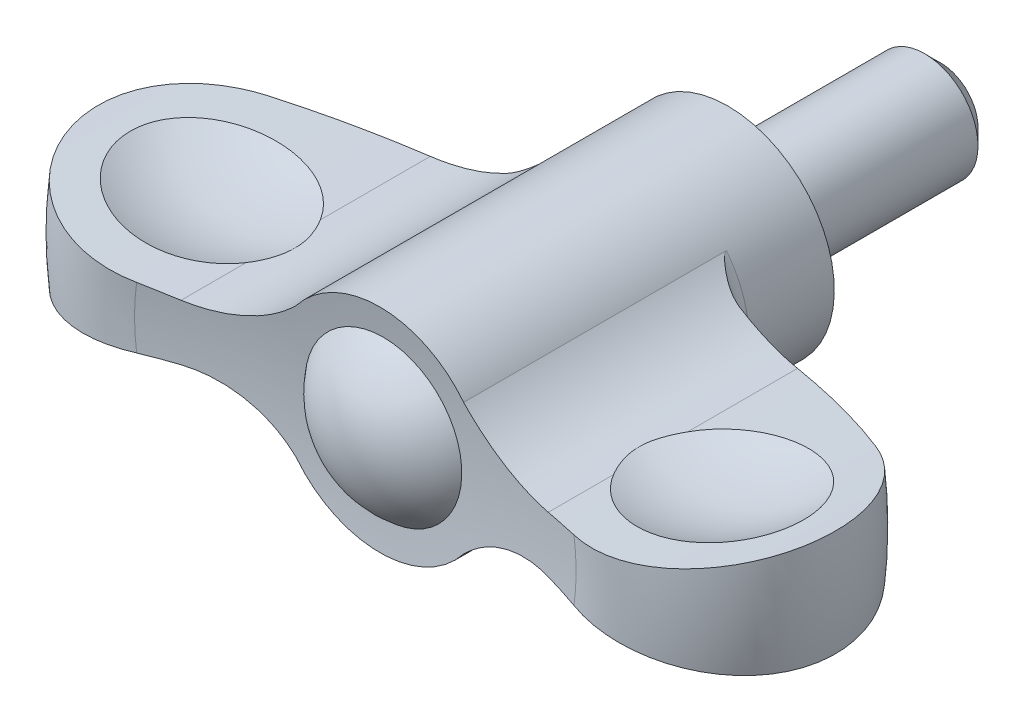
ISO-10303-21;
HEADER;
FILE_DESCRIPTION(('STEP AP214'),'2;1');
FILE_NAME('part.step','',(''),(''),'','','');
FILE_SCHEMA(('AUTOMOTIVE_DESIGN { 1 0 10303 214 1 1 1 1 }'));
ENDSEC;
DATA;
#1=APPLICATION_CONTEXT('core data for automotive mechanical design processes');
#2=APPLICATION_PROTOCOL_DEFINITION('international standard','automotive_design',2000,#1);
#3=PRODUCT_CONTEXT('',#1,'mechanical');
#4=PRODUCT('Part','Part','',(#3));
#5=PRODUCT_RELATED_PRODUCT_CATEGORY('part','',(#4));
#6=PRODUCT_DEFINITION_FORMATION('','',#4);
#7=PRODUCT_DEFINITION_CONTEXT('part definition',#1,'design');
#8=PRODUCT_DEFINITION('design','',#6,#7);
#9=PRODUCT_DEFINITION_SHAPE('','',#8);
#10=(LENGTH_UNIT() NAMED_UNIT(*) SI_UNIT(.MILLI.,.METRE.));
#11=(NAMED_UNIT(*) PLANE_ANGLE_UNIT() SI_UNIT($,.RADIAN.));
#12=(NAMED_UNIT(*) SI_UNIT($,.STERADIAN.) SOLID_ANGLE_UNIT());
#13=UNCERTAINTY_MEASURE_WITH_UNIT(LENGTH_MEASURE(1.E-05),#10,'distance_accuracy_value','');
#14=(GEOMETRIC_REPRESENTATION_CONTEXT(3) GLOBAL_UNCERTAINTY_ASSIGNED_CONTEXT((#13)) GLOBAL_UNIT_ASSIGNED_CONTEXT((#10,
#11,#12)) REPRESENTATION_CONTEXT('',''));
#15=CARTESIAN_POINT('',(0.,0.,0.));
#16=DIRECTION('',(0.,0.,1.));
#17=DIRECTION('',(1.,0.,0.));
#18=AXIS2_PLACEMENT_3D('',#15,#16,#17);
#19=CARTESIAN_POINT('',(0.,0.,8.));
#20=DIRECTION('',(0.,0.,-1.));
#21=DIRECTION('',(0.,1.,0.));
#22=AXIS2_PLACEMENT_3D('',#19,#20,#21);
#23=TOROIDAL_SURFACE('',#22,11.8,1.80000000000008);
#24=CARTESIAN_POINT('',(-10.936400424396,-3.94636818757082,9.7916319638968));
#25=CARTESIAN_POINT('',(-10.824118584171,-4.00370429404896,9.78325234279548));
#26=CARTESIAN_POINT('',(-10.7132133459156,-4.06254400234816,9.76897182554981));
#27=CARTESIAN_POINT('',(-10.4947965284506,-4.18269546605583,9.73031315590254));
#28=CARTESIAN_POINT('',(-10.3872790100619,-4.24400241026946,9.70595387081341));
#29=CARTESIAN_POINT('',(-10.1765147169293,-4.36838152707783,9.6489761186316));
#30=CARTESIAN_POINT('',(-10.0732455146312,-4.43144032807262,9.61641003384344));
#31=CARTESIAN_POINT('',(-9.87034998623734,-4.55941800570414,9.54423053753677));
#32=CARTESIAN_POINT('',(-9.77072514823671,-4.62433762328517,9.50461428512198));
#33=CARTESIAN_POINT('',(-9.55076497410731,-4.77218804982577,9.40879869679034));
#34=CARTESIAN_POINT('',(-9.43146470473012,-4.85557105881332,9.35092807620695));
#35=CARTESIAN_POINT('',(-9.19845422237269,-5.0245357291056,9.22749490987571));
#36=CARTESIAN_POINT('',(-9.08474708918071,-5.11011856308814,9.16192819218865));
#37=CARTESIAN_POINT('',(-8.89583509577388,-5.25740071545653,9.04459290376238));
#38=CARTESIAN_POINT('',(-8.81922141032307,-5.31864764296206,8.99450670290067));
#39=CARTESIAN_POINT('',(-8.66877804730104,-5.44185241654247,8.89113944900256));
#40=CARTESIAN_POINT('',(-8.59494804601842,-5.50381017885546,8.83785876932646));
#41=CARTESIAN_POINT('',(-8.4741799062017,-5.60755853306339,8.74594898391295));
#42=CARTESIAN_POINT('',(-8.42641392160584,-5.64925103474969,8.7082931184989));
#43=CARTESIAN_POINT('',(-8.33242521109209,-5.73256077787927,8.6310972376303));
#44=CARTESIAN_POINT('',(-8.28620142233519,-5.77417805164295,8.59155856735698));
#45=CARTESIAN_POINT('',(-8.21125367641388,-5.84266935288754,8.52388347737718));
#46=CARTESIAN_POINT('',(-8.18198002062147,-5.86968993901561,8.49650386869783));
#47=CARTESIAN_POINT('',(-8.12444979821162,-5.92330159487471,8.44010631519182));
#48=CARTESIAN_POINT('',(-8.09619524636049,-5.94989176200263,8.41108538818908));
#49=CARTESIAN_POINT('',(-8.04234032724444,-6.00103726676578,8.35179046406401));
#50=CARTESIAN_POINT('',(-8.01668026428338,-6.02563150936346,8.32160361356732));
#51=CARTESIAN_POINT('',(-7.96790958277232,-6.07276025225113,8.2576023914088));
#52=CARTESIAN_POINT('',(-7.94479257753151,-6.09529988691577,8.22379754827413));
#53=CARTESIAN_POINT('',(-7.91701322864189,-6.12255630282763,8.17250880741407));
#54=CARTESIAN_POINT('',(-7.90975258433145,-6.12970126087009,8.157793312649));
#55=CARTESIAN_POINT('',(-7.89665438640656,-6.14261741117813,8.12727584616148));
#56=CARTESIAN_POINT('',(-7.89080740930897,-6.14839769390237,8.11148202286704));
#57=CARTESIAN_POINT('',(-7.88158226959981,-6.15753000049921,8.08013275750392));
#58=CARTESIAN_POINT('',(-7.87802903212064,-6.16105398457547,8.06468423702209));
#59=CARTESIAN_POINT('',(-7.87307566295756,-6.16597001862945,8.03281428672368));
#60=CARTESIAN_POINT('',(-7.87172008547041,-6.16731795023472,8.01637956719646));
#61=CARTESIAN_POINT('',(-7.8717856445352,-6.16725149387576,7.9998));
#62=B_SPLINE_CURVE_WITH_KNOTS('',3,(#24,#25,#26,#27,#28,#29,#30,#31,#32,#33,#34,#35,#36,#37,#38,
#39,#40,#41,#42,#43,#44,#45,#46,#47,#48,#49,#50,#51,#52,#53,#54,#55,#56,#57,#58,#59,#60,#61),
.UNSPECIFIED.,.F.,.F.,(4,2,2,2,2,2,2,2,2,2,2,2,2,2,2,2,2,2,4),(0.,0.378686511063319,
0.756667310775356,1.13229407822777,1.50807255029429,1.97761636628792,2.44741590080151,
2.77774393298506,3.10803343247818,3.32923096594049,3.55027276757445,3.6952714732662,
3.84054267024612,3.98039395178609,4.11988557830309,4.17347981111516,4.22670627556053,
4.27513325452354,4.32453026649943),.UNSPECIFIED.);
#63=CARTESIAN_POINT('',(-10.9337221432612,-3.94773654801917,9.7914319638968));
#64=VERTEX_POINT('',#63);
#65=CARTESIAN_POINT('',(-7.8717855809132,-6.16725155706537,8.));
#66=VERTEX_POINT('',#65);
#67=EDGE_CURVE('E416',#64,#66,#62,.T.);
#68=ORIENTED_EDGE('',*,*,#67,.F.);
#69=CARTESIAN_POINT('',(0.,0.,9.7914319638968));
#70=DIRECTION('',(0.,0.,-1.));
#71=DIRECTION('',(0.,1.,0.));
#72=AXIS2_PLACEMENT_3D('',#69,#70,#71);
#73=CIRCLE('',#72,11.6245818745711);
#74=CARTESIAN_POINT('',(-10.9337221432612,3.94773654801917,9.7914319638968));
#75=VERTEX_POINT('',#74);
#76=EDGE_CURVE('E418',#64,#75,#73,.T.);
#77=ORIENTED_EDGE('',*,*,#76,.T.);
#78=CARTESIAN_POINT('',(-10.936400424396,3.94636818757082,9.7916319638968));
#79=CARTESIAN_POINT('',(-10.824118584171,4.00370429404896,9.78325234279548));
#80=CARTESIAN_POINT('',(-10.7132133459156,4.06254400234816,9.76897182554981));
#81=CARTESIAN_POINT('',(-10.4947965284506,4.18269546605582,9.73031315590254));
#82=CARTESIAN_POINT('',(-10.3872790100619,4.24400241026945,9.70595387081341));
#83=CARTESIAN_POINT('',(-10.1765147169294,4.36838152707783,9.64897611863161));
#84=CARTESIAN_POINT('',(-10.0732455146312,4.43144032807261,9.61641003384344));
#85=CARTESIAN_POINT('',(-9.87034998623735,4.55941800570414,9.54423053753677));
#86=CARTESIAN_POINT('',(-9.77072514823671,4.62433762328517,9.50461428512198));
#87=CARTESIAN_POINT('',(-9.55076497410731,4.77218804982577,9.40879869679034));
#88=CARTESIAN_POINT('',(-9.43146470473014,4.85557105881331,9.35092807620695));
#89=CARTESIAN_POINT('',(-9.1984542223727,5.02453572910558,9.22749490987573));
#90=CARTESIAN_POINT('',(-9.0847470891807,5.11011856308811,9.1619281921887));
#91=CARTESIAN_POINT('',(-8.89583509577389,5.25740071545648,9.04459290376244));
#92=CARTESIAN_POINT('',(-8.8192214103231,5.318647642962,8.99450670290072));
#93=CARTESIAN_POINT('',(-8.66877804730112,5.44185241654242,8.89113944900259));
#94=CARTESIAN_POINT('',(-8.59494804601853,5.50381017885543,8.8378587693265));
#95=CARTESIAN_POINT('',(-8.47417990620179,5.60755853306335,8.74594898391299));
#96=CARTESIAN_POINT('',(-8.4264139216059,5.64925103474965,8.70829311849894));
#97=CARTESIAN_POINT('',(-8.33242521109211,5.73256077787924,8.63109723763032));
#98=CARTESIAN_POINT('',(-8.2862014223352,5.77417805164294,8.59155856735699));
#99=CARTESIAN_POINT('',(-8.21125367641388,5.84266935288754,8.52388347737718));
#100=CARTESIAN_POINT('',(-8.18198002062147,5.86968993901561,8.49650386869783));
#101=CARTESIAN_POINT('',(-8.12444979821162,5.92330159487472,8.44010631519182));
#102=CARTESIAN_POINT('',(-8.09619524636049,5.94989176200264,8.41108538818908));
#103=CARTESIAN_POINT('',(-8.04234032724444,6.00103726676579,8.35179046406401));
#104=CARTESIAN_POINT('',(-8.01668026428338,6.02563150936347,8.32160361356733));
#105=CARTESIAN_POINT('',(-7.96790958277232,6.07276025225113,8.2576023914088));
#106=CARTESIAN_POINT('',(-7.94479257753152,6.09529988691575,8.22379754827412));
#107=CARTESIAN_POINT('',(-7.91701322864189,6.12255630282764,8.17250880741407));
#108=CARTESIAN_POINT('',(-7.90975258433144,6.1297012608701,8.15779331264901));
#109=CARTESIAN_POINT('',(-7.89665438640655,6.14261741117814,8.12727584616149));
#110=CARTESIAN_POINT('',(-7.89080740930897,6.14839769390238,8.11148202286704));
#111=CARTESIAN_POINT('',(-7.88158226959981,6.1575300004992,8.08013275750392));
#112=CARTESIAN_POINT('',(-7.87802903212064,6.16105398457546,8.06468423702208));
#113=CARTESIAN_POINT('',(-7.87307566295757,6.16597001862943,8.03281428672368));
#114=CARTESIAN_POINT('',(-7.87172008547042,6.16731795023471,8.01637956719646));
#115=CARTESIAN_POINT('',(-7.8717856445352,6.16725149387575,7.9998));
#116=B_SPLINE_CURVE_WITH_KNOTS('',3,(#78,#79,#80,#81,#82,#83,#84,#85,#86,#87,#88,#89,#90,#91,
#92,#93,#94,#95,#96,#97,#98,#99,#100,#101,#102,#103,#104,#105,#106,#107,#108,#109,#110,#111,
#112,#113,#114,#115),.UNSPECIFIED.,.F.,.F.,(4,2,2,2,2,2,2,2,2,2,2,2,2,2,2,2,2,2,4),(0.,
0.378686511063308,0.756667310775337,1.13229407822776,1.50807255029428,1.97761636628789,
2.44741590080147,2.77774393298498,3.10803343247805,3.32923096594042,3.55027276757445,
3.6952714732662,3.84054267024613,3.98039395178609,4.11988557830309,4.17347981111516,
4.22670627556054,4.27513325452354,4.32453026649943),.UNSPECIFIED.);
#117=CARTESIAN_POINT('',(-7.8717855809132,6.16725155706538,8.));
#118=VERTEX_POINT('',#117);
#119=EDGE_CURVE('E317',#75,#118,#116,.T.);
#120=ORIENTED_EDGE('',*,*,#119,.T.);
#121=CARTESIAN_POINT('',(0.,0.,8.));
#122=DIRECTION('',(0.,0.,-1.));
#123=DIRECTION('',(0.,1.,0.));
#124=AXIS2_PLACEMENT_3D('',#121,#122,#123);
#125=CIRCLE('',#124,10.);
#126=EDGE_CURVE('E420',#66,#118,#125,.T.);
#127=ORIENTED_EDGE('',*,*,#126,.F.);
#128=EDGE_LOOP('',(#68,#77,#120,#127));
#129=FACE_BOUND('',#128,.T.);
#130=ADVANCED_FACE('F14',(#129),#23,.F.);
#131=CARTESIAN_POINT('',(0.,0.,60.3122983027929));
#132=DIRECTION('',(0.,0.,-1.));
#133=DIRECTION('',(0.,1.,0.));
#134=AXIS2_PLACEMENT_3D('',#131,#132,#133);
#135=DEGENERATE_TOROIDAL_SURFACE('',#134,6.6775474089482,50.7624968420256,.T.);
#136=ORIENTED_EDGE('',*,*,#76,.F.);
#137=CARTESIAN_POINT('',(-6.5467060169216,-7.72330133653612,9.66697769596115));
#138=CARTESIAN_POINT('',(-6.64591288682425,-7.58492422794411,9.66416255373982));
#139=CARTESIAN_POINT('',(-6.74799440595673,-7.44862247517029,9.661900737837));
#140=CARTESIAN_POINT('',(-6.95774811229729,-7.18037757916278,9.65844214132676));
#141=CARTESIAN_POINT('',(-7.06542027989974,-7.04843442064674,9.6572453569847));
#142=CARTESIAN_POINT('',(-7.39653737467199,-6.6595102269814,9.65519040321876));
#143=CARTESIAN_POINT('',(-7.62812663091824,-6.40937348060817,9.65586643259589));
#144=CARTESIAN_POINT('',(-8.11129299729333,-5.92925394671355,9.66138002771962));
#145=CARTESIAN_POINT('',(-8.36287299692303,-5.69927408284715,9.66621819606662));
#146=CARTESIAN_POINT('',(-8.88421895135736,-5.26109545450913,9.68055080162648));
#147=CARTESIAN_POINT('',(-9.15398440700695,-5.05289609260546,9.69004511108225));
#148=CARTESIAN_POINT('',(-9.70731186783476,-4.66146851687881,9.71434109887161));
#149=CARTESIAN_POINT('',(-9.99073342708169,-4.47803881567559,9.72909588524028));
#150=CARTESIAN_POINT('',(-10.5714417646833,-4.13530031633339,9.76473262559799));
#151=CARTESIAN_POINT('',(-10.8687285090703,-3.97599145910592,9.78561456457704));
#152=CARTESIAN_POINT('',(-11.4746831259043,-3.68269992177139,9.83420440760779));
#153=CARTESIAN_POINT('',(-11.7833407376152,-3.54869504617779,9.86190627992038));
#154=CARTESIAN_POINT('',(-12.4099583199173,-3.30668939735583,9.92468529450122));
#155=CARTESIAN_POINT('',(-12.72791823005,-3.19868845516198,9.95976238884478));
#156=CARTESIAN_POINT('',(-13.3702784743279,-3.00943594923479,10.0375625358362));
#157=CARTESIAN_POINT('',(-13.694668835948,-2.92814595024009,10.080274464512));
#158=CARTESIAN_POINT('',(-14.3479208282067,-2.7924555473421,10.173495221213));
#159=CARTESIAN_POINT('',(-14.6767824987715,-2.73805538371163,10.2240041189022));
#160=CARTESIAN_POINT('',(-15.3369192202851,-2.65620760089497,10.3328061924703));
#161=CARTESIAN_POINT('',(-15.6681964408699,-2.62878831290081,10.3911074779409));
#162=CARTESIAN_POINT('',(-16.3304789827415,-2.60086726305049,10.5152293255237));
#163=CARTESIAN_POINT('',(-16.6614842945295,-2.60036640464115,10.5810501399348));
#164=CARTESIAN_POINT('',(-17.3240428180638,-2.62605289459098,10.7205107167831));
#165=CARTESIAN_POINT('',(-17.6555720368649,-2.65249066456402,10.7942180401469));
#166=CARTESIAN_POINT('',(-18.3138495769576,-2.73187573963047,10.9484805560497));
#167=CARTESIAN_POINT('',(-18.6405974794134,-2.78482535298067,11.0290363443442));
#168=CARTESIAN_POINT('',(-19.2867879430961,-2.91642655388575,11.1963521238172));
#169=CARTESIAN_POINT('',(-19.6062391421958,-2.99504586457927,11.2831042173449));
#170=CARTESIAN_POINT('',(-20.2362844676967,-3.17708996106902,11.4622866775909));
#171=CARTESIAN_POINT('',(-20.5468805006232,-3.28050936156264,11.5547158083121));
#172=CARTESIAN_POINT('',(-20.8521318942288,-3.39588894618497,11.6496949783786));
#173=B_SPLINE_CURVE_WITH_KNOTS('',3,(#137,#138,#139,#140,#141,#142,#143,#144,#145,#146,#147,
#148,#149,#150,#151,#152,#153,#154,#155,#156,#157,#158,#159,#160,#161,#162,#163,#164,#165,#166,
#167,#168,#169,#170,#171,#172),.UNSPECIFIED.,.F.,.F.,(4,2,2,2,2,2,2,2,2,2,2,2,2,2,2,2,2,4),(0.,
0.510785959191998,1.02157012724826,2.04291399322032,3.06440575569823,4.08586949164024,
5.09844663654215,6.11102130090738,7.12270361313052,8.13437935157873,9.14459291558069,
10.1548155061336,11.1660977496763,12.1774139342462,13.1982178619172,14.2191106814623,
15.2387247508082,16.2581176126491),.UNSPECIFIED.);
#174=CARTESIAN_POINT('',(-17.2513916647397,-2.62600423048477,10.7060191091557));
#175=VERTEX_POINT('',#174);
#176=EDGE_CURVE('E424',#64,#175,#173,.T.);
#177=ORIENTED_EDGE('',*,*,#176,.T.);
#178=CARTESIAN_POINT('',(-28.5420587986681,-3.86093353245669,14.6248916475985));
#179=CARTESIAN_POINT('',(-28.0949251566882,-3.78973654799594,14.4056959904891));
#180=CARTESIAN_POINT('',(-27.6441940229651,-3.72065339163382,14.1932196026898));
#181=CARTESIAN_POINT('',(-26.7359054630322,-3.58698745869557,13.7818878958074));
#182=CARTESIAN_POINT('',(-26.2783480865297,-3.52240464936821,13.583032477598));
#183=CARTESIAN_POINT('',(-24.8998297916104,-3.33633398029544,13.0087706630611));
#184=CARTESIAN_POINT('',(-23.9692804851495,-3.22192463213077,12.6538347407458));
#185=CARTESIAN_POINT('',(-22.0863023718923,-3.01405683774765,12.0002442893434));
#186=CARTESIAN_POINT('',(-21.133873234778,-2.92059870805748,11.701590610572));
#187=CARTESIAN_POINT('',(-19.6898454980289,-2.79722984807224,11.296179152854));
#188=CARTESIAN_POINT('',(-19.2049108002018,-2.75884755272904,11.1679139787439));
#189=CARTESIAN_POINT('',(-18.2309836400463,-2.68796520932,10.9259763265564));
#190=CARTESIAN_POINT('',(-17.7419911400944,-2.65546521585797,10.8123039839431));
#191=CARTESIAN_POINT('',(-17.2511916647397,-2.6259922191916,10.7059757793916));
#192=B_SPLINE_CURVE_WITH_KNOTS('',3,(#178,#179,#180,#181,#182,#183,#184,#185,#186,#187,#188,
#189,#190,#191),.UNSPECIFIED.,.F.,.F.,(4,2,2,2,2,2,4),(0.,1.50898291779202,3.01795485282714,
6.0232908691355,9.02867228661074,10.5376740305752,12.0466897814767),.UNSPECIFIED.);
#193=CARTESIAN_POINT('',(-28.5416508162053,-3.86086857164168,14.6246916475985));
#194=VERTEX_POINT('',#193);
#195=EDGE_CURVE('E506',#194,#175,#192,.T.);
#196=ORIENTED_EDGE('',*,*,#195,.F.);
#197=CARTESIAN_POINT('',(0.,0.,14.6246916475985));
#198=DIRECTION('',(0.,0.,-1.));
#199=DIRECTION('',(0.,1.,0.));
#200=AXIS2_PLACEMENT_3D('',#197,#198,#199);
#201=CIRCLE('',#200,28.8015995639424);
#202=CARTESIAN_POINT('',(-28.5416508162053,3.86086857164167,14.6246916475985));
#203=VERTEX_POINT('',#202);
#204=EDGE_CURVE('E434',#194,#203,#201,.T.);
#205=ORIENTED_EDGE('',*,*,#204,.T.);
#206=CARTESIAN_POINT('',(-28.542058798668,3.86093353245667,14.6248916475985));
#207=CARTESIAN_POINT('',(-28.0949251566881,3.78973654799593,14.4056959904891));
#208=CARTESIAN_POINT('',(-27.644194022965,3.7206533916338,14.1932196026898));
#209=CARTESIAN_POINT('',(-26.7359054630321,3.58698745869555,13.7818878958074));
#210=CARTESIAN_POINT('',(-26.2783480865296,3.52240464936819,13.583032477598));
#211=CARTESIAN_POINT('',(-24.8998297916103,3.33633398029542,13.0087706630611));
#212=CARTESIAN_POINT('',(-23.9692804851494,3.22192463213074,12.6538347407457));
#213=CARTESIAN_POINT('',(-22.0863023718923,3.01405683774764,12.0002442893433));
#214=CARTESIAN_POINT('',(-21.133873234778,2.92059870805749,11.701590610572));
#215=CARTESIAN_POINT('',(-19.6898454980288,2.79722984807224,11.296179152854));
#216=CARTESIAN_POINT('',(-19.2049108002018,2.75884755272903,11.1679139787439));
#217=CARTESIAN_POINT('',(-18.2309836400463,2.68796520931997,10.9259763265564));
#218=CARTESIAN_POINT('',(-17.7419911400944,2.65546521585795,10.8123039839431));
#219=CARTESIAN_POINT('',(-17.2511916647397,2.6259922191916,10.7059757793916));
#220=B_SPLINE_CURVE_WITH_KNOTS('',3,(#206,#207,#208,#209,#210,#211,#212,#213,#214,#215,#216,
#217,#218,#219),.UNSPECIFIED.,.F.,.F.,(4,2,2,2,2,2,4),(0.,1.50898291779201,3.01795485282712,
6.02329086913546,9.02867228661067,10.5376740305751,12.0466897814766),.UNSPECIFIED.);
#221=CARTESIAN_POINT('',(-17.2513916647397,2.62600423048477,10.7060191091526));
#222=VERTEX_POINT('',#221);
#223=EDGE_CURVE('E331',#203,#222,#220,.T.);
#224=ORIENTED_EDGE('',*,*,#223,.T.);
#225=CARTESIAN_POINT('',(-6.5467060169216,7.72330133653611,9.66697769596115));
#226=CARTESIAN_POINT('',(-6.64591288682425,7.5849242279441,9.66416255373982));
#227=CARTESIAN_POINT('',(-6.74799440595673,7.44862247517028,9.661900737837));
#228=CARTESIAN_POINT('',(-6.9577481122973,7.18037757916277,9.65844214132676));
#229=CARTESIAN_POINT('',(-7.06542027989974,7.04843442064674,9.6572453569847));
#230=CARTESIAN_POINT('',(-7.39653737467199,6.65951022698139,9.65519040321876));
#231=CARTESIAN_POINT('',(-7.62812663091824,6.40937348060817,9.65586643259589));
#232=CARTESIAN_POINT('',(-8.11129299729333,5.92925394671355,9.66138002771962));
#233=CARTESIAN_POINT('',(-8.36287299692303,5.69927408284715,9.66621819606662));
#234=CARTESIAN_POINT('',(-8.88421895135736,5.26109545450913,9.68055080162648));
#235=CARTESIAN_POINT('',(-9.15398440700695,5.05289609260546,9.69004511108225));
#236=CARTESIAN_POINT('',(-9.70731186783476,4.66146851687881,9.71434109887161));
#237=CARTESIAN_POINT('',(-9.99073342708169,4.47803881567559,9.72909588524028));
#238=CARTESIAN_POINT('',(-10.5714417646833,4.13530031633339,9.76473262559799));
#239=CARTESIAN_POINT('',(-10.8687285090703,3.97599145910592,9.78561456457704));
#240=CARTESIAN_POINT('',(-11.4746831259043,3.68269992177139,9.83420440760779));
#241=CARTESIAN_POINT('',(-11.7833407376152,3.54869504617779,9.86190627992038));
#242=CARTESIAN_POINT('',(-12.4099583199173,3.30668939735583,9.92468529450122));
#243=CARTESIAN_POINT('',(-12.72791823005,3.19868845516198,9.95976238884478));
#244=CARTESIAN_POINT('',(-13.3702784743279,3.00943594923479,10.0375625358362));
#245=CARTESIAN_POINT('',(-13.694668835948,2.92814595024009,10.080274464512));
#246=CARTESIAN_POINT('',(-14.3479208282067,2.7924555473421,10.173495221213));
#247=CARTESIAN_POINT('',(-14.6767824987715,2.73805538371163,10.2240041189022));
#248=CARTESIAN_POINT('',(-15.3369192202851,2.65620760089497,10.3328061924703));
#249=CARTESIAN_POINT('',(-15.6681964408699,2.62878831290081,10.3911074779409));
#250=CARTESIAN_POINT('',(-16.3304789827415,2.60086726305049,10.5152293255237));
#251=CARTESIAN_POINT('',(-16.6614842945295,2.60036640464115,10.5810501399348));
#252=CARTESIAN_POINT('',(-17.3240428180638,2.62605289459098,10.7205107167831));
#253=CARTESIAN_POINT('',(-17.6555720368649,2.65249066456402,10.7942180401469));
#254=CARTESIAN_POINT('',(-18.3138495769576,2.73187573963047,10.9484805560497));
#255=CARTESIAN_POINT('',(-18.6405974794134,2.78482535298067,11.0290363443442));
#256=CARTESIAN_POINT('',(-19.2867879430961,2.91642655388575,11.1963521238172));
#257=CARTESIAN_POINT('',(-19.6062391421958,2.99504586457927,11.2831042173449));
#258=CARTESIAN_POINT('',(-20.2362844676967,3.17708996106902,11.4622866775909));
#259=CARTESIAN_POINT('',(-20.5468805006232,3.28050936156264,11.5547158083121));
#260=CARTESIAN_POINT('',(-20.8521318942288,3.39588894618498,11.6496949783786));
#261=B_SPLINE_CURVE_WITH_KNOTS('',3,(#225,#226,#227,#228,#229,#230,#231,#232,#233,#234,#235,
#236,#237,#238,#239,#240,#241,#242,#243,#244,#245,#246,#247,#248,#249,#250,#251,#252,#253,#254,
#255,#256,#257,#258,#259,#260),.UNSPECIFIED.,.F.,.F.,(4,2,2,2,2,2,2,2,2,2,2,2,2,2,2,2,2,4),(0.,
0.510785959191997,1.02157012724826,2.04291399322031,3.06440575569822,4.08586949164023,
5.09844663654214,6.11102130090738,7.12270361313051,8.13437935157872,9.14459291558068,
10.1548155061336,11.1660977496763,12.1774139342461,13.1982178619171,14.2191106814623,
15.2387247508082,16.2581176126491),.UNSPECIFIED.);
#262=EDGE_CURVE('E300',#75,#222,#261,.T.);
#263=ORIENTED_EDGE('',*,*,#262,.F.);
#264=EDGE_LOOP('',(#136,#177,#196,#205,#224,#263));
#265=FACE_BOUND('',#264,.T.);
#266=ADVANCED_FACE('F406',(#265),#135,.T.);
#267=CARTESIAN_POINT('',(0.,0.,24.5131504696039));
#268=DIRECTION('',(0.,0.,-1.));
#269=DIRECTION('',(0.,1.,0.));
#270=AXIS2_PLACEMENT_3D('',#267,#268,#269);
#271=TOROIDAL_SURFACE('',#270,24.0131504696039,10.9868495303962);
#272=CARTESIAN_POINT('',(-17.2511916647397,-2.62599221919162,33.3242100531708));
#273=CARTESIAN_POINT('',(-17.4993781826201,-2.64089075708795,33.5086851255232));
#274=CARTESIAN_POINT('',(-17.7552628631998,-2.65706460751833,33.6826969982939));
#275=CARTESIAN_POINT('',(-18.28053769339,-2.69210530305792,34.0086627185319));
#276=CARTESIAN_POINT('',(-18.5499277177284,-2.71097212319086,34.1606167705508));
#277=CARTESIAN_POINT('',(-19.1002002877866,-2.75153205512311,34.4412740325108));
#278=CARTESIAN_POINT('',(-19.381077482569,-2.77322386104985,34.5699879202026));
#279=CARTESIAN_POINT('',(-19.952432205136,-2.81952002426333,34.8033129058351));
#280=CARTESIAN_POINT('',(-20.2429095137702,-2.84412431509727,34.9079245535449));
#281=CARTESIAN_POINT('',(-20.8315983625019,-2.89628797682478,35.0923323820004));
#282=CARTESIAN_POINT('',(-21.1298150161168,-2.92384934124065,35.1721116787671));
#283=CARTESIAN_POINT('',(-21.7316508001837,-2.98187199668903,35.3061577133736));
#284=CARTESIAN_POINT('',(-22.035269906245,-3.01233327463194,35.3604245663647));
#285=CARTESIAN_POINT('',(-22.6456357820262,-3.0760359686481,35.4430189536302));
#286=CARTESIAN_POINT('',(-22.9523815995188,-3.10927655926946,35.4713541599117));
#287=CARTESIAN_POINT('',(-23.566877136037,-3.17836345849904,35.501889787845));
#288=CARTESIAN_POINT('',(-23.874626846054,-3.21420974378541,35.504090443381));
#289=CARTESIAN_POINT('',(-24.4874432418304,-3.28807700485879,35.4823817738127));
#290=CARTESIAN_POINT('',(-24.7925157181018,-3.32608674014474,35.4585974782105));
#291=CARTESIAN_POINT('',(-25.3992908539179,-3.404117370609,35.3852808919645));
#292=CARTESIAN_POINT('',(-25.7009935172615,-3.44413826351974,35.3357486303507));
#293=CARTESIAN_POINT('',(-26.2989412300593,-3.52581537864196,35.211278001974));
#294=CARTESIAN_POINT('',(-26.595185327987,-3.56747188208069,35.1363352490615));
#295=CARTESIAN_POINT('',(-27.1800717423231,-3.65197221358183,34.9615826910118));
#296=CARTESIAN_POINT('',(-27.4687140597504,-3.69481604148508,34.8617728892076));
#297=CARTESIAN_POINT('',(-28.035952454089,-3.78113479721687,34.6381665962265));
#298=CARTESIAN_POINT('',(-28.3145627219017,-3.82460870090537,34.514405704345));
#299=CARTESIAN_POINT('',(-28.8602471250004,-3.9117173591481,34.2436848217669));
#300=CARTESIAN_POINT('',(-29.1273212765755,-3.9553521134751,34.0967248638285));
#301=CARTESIAN_POINT('',(-29.6480727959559,-4.04221651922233,33.7806574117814));
#302=CARTESIAN_POINT('',(-29.9017509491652,-4.08544619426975,33.6115512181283));
#303=CARTESIAN_POINT('',(-30.3939845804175,-4.17091924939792,33.2523788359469));
#304=CARTESIAN_POINT('',(-30.6325400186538,-4.21316262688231,33.0623125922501));
#305=CARTESIAN_POINT('',(-31.0935716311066,-4.29619199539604,32.6619711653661));
#306=CARTESIAN_POINT('',(-31.3159985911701,-4.33697334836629,32.4516383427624));
#307=CARTESIAN_POINT('',(-31.7424740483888,-4.41635307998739,32.0127202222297));
#308=CARTESIAN_POINT('',(-31.9465225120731,-4.45495145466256,31.7841348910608));
#309=CARTESIAN_POINT('',(-32.3348520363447,-4.5293877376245,31.3103146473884));
#310=CARTESIAN_POINT('',(-32.5191323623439,-4.56522554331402,31.0650791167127));
#311=CARTESIAN_POINT('',(-32.8666572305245,-4.63358841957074,30.5596945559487));
#312=CARTESIAN_POINT('',(-33.0299017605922,-4.66611348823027,30.2995455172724));
#313=CARTESIAN_POINT('',(-33.3345075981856,-4.72739462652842,29.7656976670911));
#314=CARTESIAN_POINT('',(-33.4758297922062,-4.75614394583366,29.4919757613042));
#315=CARTESIAN_POINT('',(-33.7352733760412,-4.80934524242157,28.9333467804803));
#316=CARTESIAN_POINT('',(-33.8533947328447,-4.83379721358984,28.6484396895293));
#317=CARTESIAN_POINT('',(-34.0656204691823,-4.87800530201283,28.0694731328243));
#318=CARTESIAN_POINT('',(-34.1597255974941,-4.89776156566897,27.7754139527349));
#319=CARTESIAN_POINT('',(-34.3232748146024,-4.93225390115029,27.180228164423));
#320=CARTESIAN_POINT('',(-34.3927189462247,-4.94698998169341,26.8791015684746));
#321=CARTESIAN_POINT('',(-34.5063857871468,-4.97117989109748,26.2723608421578));
#322=CARTESIAN_POINT('',(-34.5506442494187,-4.98064120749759,25.96675370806));
#323=CARTESIAN_POINT('',(-34.6137870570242,-4.99415603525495,25.3528106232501));
#324=CARTESIAN_POINT('',(-34.6326714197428,-4.99820955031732,25.0444746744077));
#325=CARTESIAN_POINT('',(-34.644935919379,-5.00084099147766,24.4272603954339));
#326=CARTESIAN_POINT('',(-34.6383150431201,-4.99941870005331,24.1183820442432));
#327=CARTESIAN_POINT('',(-34.5996125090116,-4.9911218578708,23.5022985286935));
#328=CARTESIAN_POINT('',(-34.5675308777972,-4.9842473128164,23.1950933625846));
#329=CARTESIAN_POINT('',(-34.4781950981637,-4.96517513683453,22.5850017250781));
#330=CARTESIAN_POINT('',(-34.4209785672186,-4.95298546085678,22.2821094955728));
#331=CARTESIAN_POINT('',(-34.2817747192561,-4.92348679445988,21.6823260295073));
#332=CARTESIAN_POINT('',(-34.1997873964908,-4.90617780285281,21.3854347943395));
#333=CARTESIAN_POINT('',(-34.0116119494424,-4.86672680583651,20.799780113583));
#334=CARTESIAN_POINT('',(-33.9054257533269,-4.84458518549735,20.5110160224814));
#335=CARTESIAN_POINT('',(-33.6695763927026,-4.79582854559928,19.9436331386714));
#336=CARTESIAN_POINT('',(-33.5399133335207,-4.76921354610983,19.6650143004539));
#337=CARTESIAN_POINT('',(-33.2578321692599,-4.71190410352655,19.1195687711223));
#338=CARTESIAN_POINT('',(-33.1053878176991,-4.68120495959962,18.8527561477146));
#339=CARTESIAN_POINT('',(-32.7788934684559,-4.61623623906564,18.3331441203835));
#340=CARTESIAN_POINT('',(-32.6048429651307,-4.58196657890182,18.0803450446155));
#341=CARTESIAN_POINT('',(-32.2363296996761,-4.51038975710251,17.5905487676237));
#342=CARTESIAN_POINT('',(-32.0418667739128,-4.47308257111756,17.3535516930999));
#343=CARTESIAN_POINT('',(-31.633867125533,-4.39599896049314,16.8970435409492));
#344=CARTESIAN_POINT('',(-31.4203320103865,-4.35622274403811,16.6775309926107));
#345=CARTESIAN_POINT('',(-31.0011481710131,-4.27945832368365,16.2816097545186));
#346=CARTESIAN_POINT('',(-30.797399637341,-4.24267293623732,16.103144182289));
#347=CARTESIAN_POINT('',(-30.377205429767,-4.16804353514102,15.7621159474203));
#348=CARTESIAN_POINT('',(-30.1607608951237,-4.13019961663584,15.5995518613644));
#349=CARTESIAN_POINT('',(-29.7163820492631,-4.05387450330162,15.2912603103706));
#350=CARTESIAN_POINT('',(-29.4884504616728,-4.01539346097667,15.1455288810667));
#351=CARTESIAN_POINT('',(-29.0222683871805,-3.9381829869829,14.871631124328));
#352=CARTESIAN_POINT('',(-28.7840165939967,-3.89945352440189,14.7434670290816));
#353=CARTESIAN_POINT('',(-28.5412428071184,-3.86080360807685,14.6244916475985));
#354=B_SPLINE_CURVE_WITH_KNOTS('',3,(#272,#273,#274,#275,#276,#277,#278,#279,#280,#281,#282,
#283,#284,#285,#286,#287,#288,#289,#290,#291,#292,#293,#294,#295,#296,#297,#298,#299,#300,#301,
#302,#303,#304,#305,#306,#307,#308,#309,#310,#311,#312,#313,#314,#315,#316,#317,#318,#319,#320,
#321,#322,#323,#324,#325,#326,#327,#328,#329,#330,#331,#332,#333,#334,#335,#336,#337,#338,#339,
#340,#341,#342,#343,#344,#345,#346,#347,#348,#349,#350,#351,#352,#353),.UNSPECIFIED.,.F.,.F.,(4,
2,2,2,2,2,2,2,2,2,2,2,2,2,2,2,2,2,2,2,2,2,2,2,2,2,2,2,2,2,2,2,2,2,2,2,2,2,2,2,4),(0.,
0.928513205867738,1.85701780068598,2.7850947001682,3.7131504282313,4.64183578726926,
5.57051695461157,6.49892327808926,7.42732129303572,8.35127181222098,9.27522128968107,
10.1993303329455,11.1234392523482,12.0461850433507,12.9689295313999,13.8916198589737,
14.8143126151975,15.7397117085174,16.6651124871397,17.5905476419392,18.5159833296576,
19.4430516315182,20.3701212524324,21.2971619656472,22.2242010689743,23.1499208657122,
24.0756400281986,25.0013959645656,25.9271509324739,26.8515250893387,27.7758994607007,
28.7002002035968,29.6244967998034,30.5498666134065,31.4752580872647,32.4006569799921,
33.3259779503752,34.1452666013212,34.9644818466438,35.7835037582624,36.6026296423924),.UNSPECIFIED.);
#355=CARTESIAN_POINT('',(-20.5453214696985,-2.87092129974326,35.0026521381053));
#356=VERTEX_POINT('',#355);
#357=EDGE_CURVE('E497',#356,#194,#354,.T.);
#358=ORIENTED_EDGE('',*,*,#357,.F.);
#359=CARTESIAN_POINT('',(0.,0.,35.0026521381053));
#360=DIRECTION('',(0.,0.,-1.));
#361=DIRECTION('',(0.,1.,0.));
#362=AXIS2_PLACEMENT_3D('',#359,#360,#361);
#363=CIRCLE('',#362,20.7449372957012);
#364=CARTESIAN_POINT('',(-20.5453214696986,2.87092129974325,35.0026521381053));
#365=VERTEX_POINT('',#364);
#366=EDGE_CURVE('E487',#356,#365,#363,.T.);
#367=ORIENTED_EDGE('',*,*,#366,.T.);
#368=CARTESIAN_POINT('',(-17.2511916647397,2.6259922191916,33.3242100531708));
#369=CARTESIAN_POINT('',(-17.4993781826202,2.64089075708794,33.5086851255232));
#370=CARTESIAN_POINT('',(-17.7552628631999,2.65706460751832,33.6826969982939));
#371=CARTESIAN_POINT('',(-18.28053769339,2.69210530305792,34.0086627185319));
#372=CARTESIAN_POINT('',(-18.5499277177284,2.71097212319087,34.1606167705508));
#373=CARTESIAN_POINT('',(-19.1002002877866,2.75153205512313,34.4412740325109));
#374=CARTESIAN_POINT('',(-19.3810774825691,2.77322386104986,34.5699879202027));
#375=CARTESIAN_POINT('',(-19.952432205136,2.81952002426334,34.8033129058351));
#376=CARTESIAN_POINT('',(-20.2429095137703,2.84412431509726,34.9079245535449));
#377=CARTESIAN_POINT('',(-20.831598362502,2.89628797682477,35.0923323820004));
#378=CARTESIAN_POINT('',(-21.1298150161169,2.92384934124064,35.1721116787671));
#379=CARTESIAN_POINT('',(-21.7316508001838,2.98187199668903,35.3061577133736));
#380=CARTESIAN_POINT('',(-22.0352699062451,3.01233327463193,35.3604245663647));
#381=CARTESIAN_POINT('',(-22.6456357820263,3.0760359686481,35.4430189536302));
#382=CARTESIAN_POINT('',(-22.9523815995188,3.10927655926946,35.4713541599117));
#383=CARTESIAN_POINT('',(-23.566877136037,3.17836345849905,35.501889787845));
#384=CARTESIAN_POINT('',(-23.874626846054,3.21420974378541,35.504090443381));
#385=CARTESIAN_POINT('',(-24.4874432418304,3.28807700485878,35.4823817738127));
#386=CARTESIAN_POINT('',(-24.7925157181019,3.32608674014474,35.4585974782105));
#387=CARTESIAN_POINT('',(-25.3992908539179,3.404117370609,35.3852808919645));
#388=CARTESIAN_POINT('',(-25.7009935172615,3.44413826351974,35.3357486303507));
#389=CARTESIAN_POINT('',(-26.2989412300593,3.52581537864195,35.211278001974));
#390=CARTESIAN_POINT('',(-26.595185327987,3.56747188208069,35.1363352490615));
#391=CARTESIAN_POINT('',(-27.1800717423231,3.65197221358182,34.9615826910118));
#392=CARTESIAN_POINT('',(-27.4687140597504,3.69481604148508,34.8617728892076));
#393=CARTESIAN_POINT('',(-28.035952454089,3.78113479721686,34.6381665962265));
#394=CARTESIAN_POINT('',(-28.3145627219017,3.82460870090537,34.514405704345));
#395=CARTESIAN_POINT('',(-28.8602471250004,3.9117173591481,34.2436848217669));
#396=CARTESIAN_POINT('',(-29.1273212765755,3.9553521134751,34.0967248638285));
#397=CARTESIAN_POINT('',(-29.6480727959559,4.04221651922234,33.7806574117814));
#398=CARTESIAN_POINT('',(-29.9017509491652,4.08544619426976,33.6115512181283));
#399=CARTESIAN_POINT('',(-30.3939845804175,4.17091924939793,33.2523788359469));
#400=CARTESIAN_POINT('',(-30.6325400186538,4.21316262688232,33.0623125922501));
#401=CARTESIAN_POINT('',(-31.0935716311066,4.29619199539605,32.6619711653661));
#402=CARTESIAN_POINT('',(-31.3159985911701,4.33697334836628,32.4516383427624));
#403=CARTESIAN_POINT('',(-31.7424740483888,4.41635307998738,32.0127202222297));
#404=CARTESIAN_POINT('',(-31.9465225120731,4.45495145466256,31.7841348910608));
#405=CARTESIAN_POINT('',(-32.3348520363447,4.52938773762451,31.3103146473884));
#406=CARTESIAN_POINT('',(-32.5191323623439,4.56522554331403,31.0650791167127));
#407=CARTESIAN_POINT('',(-32.8666572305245,4.63358841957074,30.5596945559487));
#408=CARTESIAN_POINT('',(-33.0299017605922,4.66611348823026,30.2995455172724));
#409=CARTESIAN_POINT('',(-33.3345075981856,4.72739462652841,29.7656976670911));
#410=CARTESIAN_POINT('',(-33.4758297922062,4.75614394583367,29.4919757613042));
#411=CARTESIAN_POINT('',(-33.7352733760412,4.80934524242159,28.9333467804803));
#412=CARTESIAN_POINT('',(-33.8533947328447,4.83379721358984,28.6484396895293));
#413=CARTESIAN_POINT('',(-34.0656204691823,4.87800530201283,28.0694731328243));
#414=CARTESIAN_POINT('',(-34.1597255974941,4.89776156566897,27.7754139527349));
#415=CARTESIAN_POINT('',(-34.3232748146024,4.93225390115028,27.180228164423));
#416=CARTESIAN_POINT('',(-34.3927189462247,4.9469899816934,26.8791015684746));
#417=CARTESIAN_POINT('',(-34.5063857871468,4.97117989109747,26.2723608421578));
#418=CARTESIAN_POINT('',(-34.5506442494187,4.9806412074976,25.96675370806));
#419=CARTESIAN_POINT('',(-34.6137870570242,4.99415603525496,25.3528106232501));
#420=CARTESIAN_POINT('',(-34.6326714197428,4.99820955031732,25.0444746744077));
#421=CARTESIAN_POINT('',(-34.644935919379,5.00084099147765,24.4272603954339));
#422=CARTESIAN_POINT('',(-34.6383150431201,4.9994187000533,24.1183820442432));
#423=CARTESIAN_POINT('',(-34.5996125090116,4.99112185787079,23.5022985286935));
#424=CARTESIAN_POINT('',(-34.5675308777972,4.98424731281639,23.1950933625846));
#425=CARTESIAN_POINT('',(-34.4781950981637,4.96517513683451,22.5850017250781));
#426=CARTESIAN_POINT('',(-34.4209785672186,4.95298546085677,22.2821094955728));
#427=CARTESIAN_POINT('',(-34.2817747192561,4.92348679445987,21.6823260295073));
#428=CARTESIAN_POINT('',(-34.1997873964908,4.90617780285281,21.3854347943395));
#429=CARTESIAN_POINT('',(-34.0116119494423,4.86672680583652,20.7997801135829));
#430=CARTESIAN_POINT('',(-33.9054257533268,4.84458518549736,20.5110160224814));
#431=CARTESIAN_POINT('',(-33.6695763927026,4.79582854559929,19.9436331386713));
#432=CARTESIAN_POINT('',(-33.5399133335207,4.76921354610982,19.6650143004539));
#433=CARTESIAN_POINT('',(-33.2578321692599,4.71190410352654,19.1195687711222));
#434=CARTESIAN_POINT('',(-33.1053878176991,4.68120495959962,18.8527561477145));
#435=CARTESIAN_POINT('',(-32.7788934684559,4.61623623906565,18.3331441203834));
#436=CARTESIAN_POINT('',(-32.6048429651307,4.58196657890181,18.0803450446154));
#437=CARTESIAN_POINT('',(-32.2363296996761,4.5103897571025,17.5905487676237));
#438=CARTESIAN_POINT('',(-32.0418667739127,4.47308257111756,17.3535516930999));
#439=CARTESIAN_POINT('',(-31.633867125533,4.39599896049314,16.8970435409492));
#440=CARTESIAN_POINT('',(-31.4203320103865,4.3562227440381,16.6775309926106));
#441=CARTESIAN_POINT('',(-31.0011481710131,4.27945832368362,16.2816097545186));
#442=CARTESIAN_POINT('',(-30.797399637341,4.2426729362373,16.103144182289));
#443=CARTESIAN_POINT('',(-30.377205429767,4.16804353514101,15.7621159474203));
#444=CARTESIAN_POINT('',(-30.1607608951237,4.13019961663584,15.5995518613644));
#445=CARTESIAN_POINT('',(-29.7163820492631,4.05387450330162,15.2912603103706));
#446=CARTESIAN_POINT('',(-29.4884504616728,4.01539346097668,15.1455288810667));
#447=CARTESIAN_POINT('',(-29.0222683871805,3.93818298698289,14.871631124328));
#448=CARTESIAN_POINT('',(-28.7840165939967,3.89945352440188,14.7434670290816));
#449=CARTESIAN_POINT('',(-28.5412428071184,3.86080360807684,14.6244916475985));
#450=B_SPLINE_CURVE_WITH_KNOTS('',3,(#368,#369,#370,#371,#372,#373,#374,#375,#376,#377,#378,
#379,#380,#381,#382,#383,#384,#385,#386,#387,#388,#389,#390,#391,#392,#393,#394,#395,#396,#397,
#398,#399,#400,#401,#402,#403,#404,#405,#406,#407,#408,#409,#410,#411,#412,#413,#414,#415,#416,
#417,#418,#419,#420,#421,#422,#423,#424,#425,#426,#427,#428,#429,#430,#431,#432,#433,#434,#435,
#436,#437,#438,#439,#440,#441,#442,#443,#444,#445,#446,#447,#448,#449),.UNSPECIFIED.,.F.,.F.,(4,
2,2,2,2,2,2,2,2,2,2,2,2,2,2,2,2,2,2,2,2,2,2,2,2,2,2,2,2,2,2,2,2,2,2,2,2,2,2,2,4),(0.,
0.92851320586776,1.85701780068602,2.78509470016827,3.7131504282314,4.64183578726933,
5.57051695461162,6.49892327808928,7.42732129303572,8.35127181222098,9.27522128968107,
10.1993303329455,11.1234392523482,12.0461850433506,12.9689295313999,13.8916198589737,
14.8143126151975,15.7397117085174,16.6651124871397,17.5905476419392,18.5159833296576,
19.4430516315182,20.3701212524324,21.2971619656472,22.2242010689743,23.1499208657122,
24.0756400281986,25.0013959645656,25.9271509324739,26.8515250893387,27.7758994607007,
28.7002002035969,29.6244967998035,30.5498666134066,31.4752580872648,32.4006569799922,
33.3259779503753,34.1452666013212,34.9644818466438,35.7835037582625,36.6026296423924),.UNSPECIFIED.);
#451=EDGE_CURVE('E324',#365,#203,#450,.T.);
#452=ORIENTED_EDGE('',*,*,#451,.T.);
#453=ORIENTED_EDGE('',*,*,#204,.F.);
#454=EDGE_LOOP('',(#358,#367,#452,#453));
#455=FACE_BOUND('',#454,.T.);
#456=ADVANCED_FACE('F337',(#455),#271,.T.);
#457=CARTESIAN_POINT('',(17.2511916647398,2.6259922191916,33.3242100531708));
#458=CARTESIAN_POINT('',(17.4993781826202,2.64089075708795,33.5086851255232));
#459=CARTESIAN_POINT('',(17.7552628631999,2.65706460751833,33.6826969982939));
#460=CARTESIAN_POINT('',(18.28053769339,2.69210530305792,34.0086627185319));
#461=CARTESIAN_POINT('',(18.5499277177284,2.71097212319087,34.1606167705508));
#462=CARTESIAN_POINT('',(19.1002002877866,2.75153205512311,34.4412740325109));
#463=CARTESIAN_POINT('',(19.3810774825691,2.77322386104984,34.5699879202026));
#464=CARTESIAN_POINT('',(19.952432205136,2.81952002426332,34.8033129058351));
#465=CARTESIAN_POINT('',(20.2429095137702,2.84412431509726,34.9079245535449));
#466=CARTESIAN_POINT('',(20.8315983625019,2.89628797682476,35.0923323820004));
#467=CARTESIAN_POINT('',(21.1298150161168,2.92384934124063,35.1721116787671));
#468=CARTESIAN_POINT('',(21.7316508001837,2.98187199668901,35.3061577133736));
#469=CARTESIAN_POINT('',(22.035269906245,3.01233327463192,35.3604245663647));
#470=CARTESIAN_POINT('',(22.6456357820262,3.07603596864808,35.4430189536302));
#471=CARTESIAN_POINT('',(22.9523815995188,3.10927655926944,35.4713541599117));
#472=CARTESIAN_POINT('',(23.566877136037,3.17836345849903,35.501889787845));
#473=CARTESIAN_POINT('',(23.874626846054,3.21420974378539,35.504090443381));
#474=CARTESIAN_POINT('',(24.4874432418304,3.28807700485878,35.4823817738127));
#475=CARTESIAN_POINT('',(24.7925157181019,3.32608674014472,35.4585974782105));
#476=CARTESIAN_POINT('',(25.3992908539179,3.40411737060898,35.3852808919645));
#477=CARTESIAN_POINT('',(25.7009935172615,3.44413826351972,35.3357486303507));
#478=CARTESIAN_POINT('',(26.2989412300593,3.52581537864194,35.211278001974));
#479=CARTESIAN_POINT('',(26.595185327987,3.56747188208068,35.1363352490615));
#480=CARTESIAN_POINT('',(27.1800717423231,3.65197221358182,34.9615826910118));
#481=CARTESIAN_POINT('',(27.4687140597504,3.69481604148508,34.8617728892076));
#482=CARTESIAN_POINT('',(28.035952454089,3.78113479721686,34.6381665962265));
#483=CARTESIAN_POINT('',(28.3145627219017,3.82460870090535,34.514405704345));
#484=CARTESIAN_POINT('',(28.8602471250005,3.91171735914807,34.2436848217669));
#485=CARTESIAN_POINT('',(29.1273212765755,3.95535211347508,34.0967248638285));
#486=CARTESIAN_POINT('',(29.6480727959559,4.04221651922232,33.7806574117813));
#487=CARTESIAN_POINT('',(29.9017509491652,4.08544619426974,33.6115512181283));
#488=CARTESIAN_POINT('',(30.3939845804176,4.17091924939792,33.2523788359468));
#489=CARTESIAN_POINT('',(30.6325400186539,4.21316262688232,33.0623125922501));
#490=CARTESIAN_POINT('',(31.0935716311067,4.29619199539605,32.6619711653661));
#491=CARTESIAN_POINT('',(31.3159985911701,4.33697334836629,32.4516383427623));
#492=CARTESIAN_POINT('',(31.7424740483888,4.41635307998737,32.0127202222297));
#493=CARTESIAN_POINT('',(31.9465225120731,4.45495145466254,31.7841348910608));
#494=CARTESIAN_POINT('',(32.3348520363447,4.52938773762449,31.3103146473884));
#495=CARTESIAN_POINT('',(32.5191323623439,4.56522554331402,31.0650791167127));
#496=CARTESIAN_POINT('',(32.8666572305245,4.63358841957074,30.5596945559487));
#497=CARTESIAN_POINT('',(33.0299017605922,4.66611348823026,30.2995455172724));
#498=CARTESIAN_POINT('',(33.3345075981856,4.72739462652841,29.7656976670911));
#499=CARTESIAN_POINT('',(33.4758297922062,4.75614394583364,29.4919757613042));
#500=CARTESIAN_POINT('',(33.7352733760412,4.80934524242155,28.9333467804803));
#501=CARTESIAN_POINT('',(33.8533947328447,4.83379721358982,28.6484396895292));
#502=CARTESIAN_POINT('',(34.0656204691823,4.87800530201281,28.0694731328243));
#503=CARTESIAN_POINT('',(34.1597255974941,4.89776156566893,27.7754139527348));
#504=CARTESIAN_POINT('',(34.3232748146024,4.93225390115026,27.180228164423));
#505=CARTESIAN_POINT('',(34.3927189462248,4.94698998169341,26.8791015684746));
#506=CARTESIAN_POINT('',(34.5063857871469,4.97117989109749,26.2723608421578));
#507=CARTESIAN_POINT('',(34.5506442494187,4.98064120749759,25.96675370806));
#508=CARTESIAN_POINT('',(34.6137870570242,4.99415603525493,25.3528106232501));
#509=CARTESIAN_POINT('',(34.6326714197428,4.99820955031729,25.0444746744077));
#510=CARTESIAN_POINT('',(34.644935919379,5.00084099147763,24.4272603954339));
#511=CARTESIAN_POINT('',(34.6383150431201,4.9994187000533,24.1183820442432));
#512=CARTESIAN_POINT('',(34.5996125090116,4.9911218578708,23.5022985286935));
#513=CARTESIAN_POINT('',(34.5675308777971,4.9842473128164,23.1950933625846));
#514=CARTESIAN_POINT('',(34.4781950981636,4.96517513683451,22.5850017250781));
#515=CARTESIAN_POINT('',(34.4209785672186,4.95298546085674,22.2821094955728));
#516=CARTESIAN_POINT('',(34.2817747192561,4.92348679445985,21.6823260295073));
#517=CARTESIAN_POINT('',(34.1997873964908,4.9061778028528,21.3854347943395));
#518=CARTESIAN_POINT('',(34.0116119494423,4.86672680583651,20.799780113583));
#519=CARTESIAN_POINT('',(33.9054257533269,4.84458518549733,20.5110160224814));
#520=CARTESIAN_POINT('',(33.6695763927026,4.79582854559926,19.9436331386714));
#521=CARTESIAN_POINT('',(33.5399133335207,4.76921354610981,19.6650143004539));
#522=CARTESIAN_POINT('',(33.2578321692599,4.71190410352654,19.1195687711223));
#523=CARTESIAN_POINT('',(33.1053878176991,4.68120495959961,18.8527561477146));
#524=CARTESIAN_POINT('',(32.7788934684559,4.61623623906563,18.3331441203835));
#525=CARTESIAN_POINT('',(32.6048429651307,4.5819665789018,18.0803450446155));
#526=CARTESIAN_POINT('',(32.2363296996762,4.51038975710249,17.5905487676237));
#527=CARTESIAN_POINT('',(32.0418667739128,4.47308257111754,17.3535516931));
#528=CARTESIAN_POINT('',(31.6338671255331,4.39599896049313,16.8970435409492));
#529=CARTESIAN_POINT('',(31.4203320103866,4.3562227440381,16.6775309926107));
#530=CARTESIAN_POINT('',(31.0011481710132,4.27945832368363,16.2816097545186));
#531=CARTESIAN_POINT('',(30.797399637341,4.2426729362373,16.103144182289));
#532=CARTESIAN_POINT('',(30.3772054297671,4.168043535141,15.7621159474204));
#533=CARTESIAN_POINT('',(30.1607608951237,4.13019961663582,15.5995518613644));
#534=CARTESIAN_POINT('',(29.7163820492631,4.0538745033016,15.2912603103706));
#535=CARTESIAN_POINT('',(29.4884504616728,4.01539346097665,15.1455288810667));
#536=CARTESIAN_POINT('',(29.0222683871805,3.93818298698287,14.871631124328));
#537=CARTESIAN_POINT('',(28.7840165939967,3.89945352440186,14.7434670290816));
#538=CARTESIAN_POINT('',(28.5412428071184,3.86080360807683,14.6244916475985));
#539=B_SPLINE_CURVE_WITH_KNOTS('',3,(#457,#458,#459,#460,#461,#462,#463,#464,#465,#466,#467,
#468,#469,#470,#471,#472,#473,#474,#475,#476,#477,#478,#479,#480,#481,#482,#483,#484,#485,#486,
#487,#488,#489,#490,#491,#492,#493,#494,#495,#496,#497,#498,#499,#500,#501,#502,#503,#504,#505,
#506,#507,#508,#509,#510,#511,#512,#513,#514,#515,#516,#517,#518,#519,#520,#521,#522,#523,#524,
#525,#526,#527,#528,#529,#530,#531,#532,#533,#534,#535,#536,#537,#538),.UNSPECIFIED.,.F.,.F.,(4,
2,2,2,2,2,2,2,2,2,2,2,2,2,2,2,2,2,2,2,2,2,2,2,2,2,2,2,2,2,2,2,2,2,2,2,2,2,2,2,4),(0.,
0.928513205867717,1.85701780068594,2.78509470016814,3.71315042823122,4.64183578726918,
5.57051695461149,6.49892327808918,7.42732129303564,8.3512718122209,9.275221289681,
10.1993303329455,11.1234392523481,12.0461850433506,12.9689295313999,13.8916198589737,
14.8143126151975,15.7397117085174,16.6651124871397,17.5905476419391,18.5159833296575,
19.4430516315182,20.3701212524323,21.2971619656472,22.2242010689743,23.1499208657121,
24.0756400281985,25.0013959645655,25.9271509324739,26.8515250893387,27.7758994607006,
28.7002002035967,29.6244967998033,30.5498666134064,31.4752580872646,32.400656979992,
33.3259779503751,34.145266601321,34.9644818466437,35.7835037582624,36.6026296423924),.UNSPECIFIED.);
#540=CARTESIAN_POINT('',(20.5453214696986,2.87092129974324,35.0026521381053));
#541=VERTEX_POINT('',#540);
#542=CARTESIAN_POINT('',(28.5416508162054,3.86086857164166,14.6246916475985));
#543=VERTEX_POINT('',#542);
#544=EDGE_CURVE('E534',#541,#543,#539,.T.);
#545=ORIENTED_EDGE('',*,*,#544,.F.);
#546=CARTESIAN_POINT('',(20.5453214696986,-2.87092129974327,35.0026521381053));
#547=VERTEX_POINT('',#546);
#548=EDGE_CURVE('E488',#541,#547,#363,.T.);
#549=ORIENTED_EDGE('',*,*,#548,.T.);
#550=CARTESIAN_POINT('',(17.2511916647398,-2.62599221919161,33.3242100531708));
#551=CARTESIAN_POINT('',(17.4993781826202,-2.64089075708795,33.5086851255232));
#552=CARTESIAN_POINT('',(17.7552628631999,-2.65706460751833,33.6826969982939));
#553=CARTESIAN_POINT('',(18.28053769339,-2.69210530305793,34.0086627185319));
#554=CARTESIAN_POINT('',(18.5499277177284,-2.71097212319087,34.1606167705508));
#555=CARTESIAN_POINT('',(19.1002002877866,-2.75153205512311,34.4412740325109));
#556=CARTESIAN_POINT('',(19.3810774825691,-2.77322386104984,34.5699879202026));
#557=CARTESIAN_POINT('',(19.952432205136,-2.81952002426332,34.8033129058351));
#558=CARTESIAN_POINT('',(20.2429095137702,-2.84412431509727,34.9079245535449));
#559=CARTESIAN_POINT('',(20.8315983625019,-2.89628797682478,35.0923323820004));
#560=CARTESIAN_POINT('',(21.1298150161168,-2.92384934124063,35.1721116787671));
#561=CARTESIAN_POINT('',(21.7316508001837,-2.98187199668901,35.3061577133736));
#562=CARTESIAN_POINT('',(22.035269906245,-3.01233327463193,35.3604245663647));
#563=CARTESIAN_POINT('',(22.6456357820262,-3.07603596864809,35.4430189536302));
#564=CARTESIAN_POINT('',(22.9523815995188,-3.10927655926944,35.4713541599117));
#565=CARTESIAN_POINT('',(23.566877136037,-3.17836345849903,35.501889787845));
#566=CARTESIAN_POINT('',(23.874626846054,-3.21420974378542,35.504090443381));
#567=CARTESIAN_POINT('',(24.4874432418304,-3.2880770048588,35.4823817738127));
#568=CARTESIAN_POINT('',(24.7925157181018,-3.32608674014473,35.4585974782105));
#569=CARTESIAN_POINT('',(25.3992908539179,-3.40411737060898,35.3852808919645));
#570=CARTESIAN_POINT('',(25.7009935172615,-3.44413826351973,35.3357486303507));
#571=CARTESIAN_POINT('',(26.2989412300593,-3.52581537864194,35.211278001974));
#572=CARTESIAN_POINT('',(26.595185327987,-3.56747188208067,35.1363352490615));
#573=CARTESIAN_POINT('',(27.1800717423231,-3.65197221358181,34.9615826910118));
#574=CARTESIAN_POINT('',(27.4687140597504,-3.69481604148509,34.8617728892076));
#575=CARTESIAN_POINT('',(28.035952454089,-3.78113479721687,34.6381665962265));
#576=CARTESIAN_POINT('',(28.3145627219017,-3.82460870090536,34.514405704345));
#577=CARTESIAN_POINT('',(28.8602471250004,-3.91171735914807,34.2436848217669));
#578=CARTESIAN_POINT('',(29.1273212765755,-3.95535211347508,34.0967248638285));
#579=CARTESIAN_POINT('',(29.6480727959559,-4.04221651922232,33.7806574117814));
#580=CARTESIAN_POINT('',(29.9017509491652,-4.08544619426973,33.6115512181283));
#581=CARTESIAN_POINT('',(30.3939845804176,-4.17091924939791,33.2523788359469));
#582=CARTESIAN_POINT('',(30.6325400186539,-4.21316262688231,33.0623125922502));
#583=CARTESIAN_POINT('',(31.0935716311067,-4.29619199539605,32.6619711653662));
#584=CARTESIAN_POINT('',(31.3159985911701,-4.33697334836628,32.4516383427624));
#585=CARTESIAN_POINT('',(31.7424740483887,-4.41635307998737,32.0127202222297));
#586=CARTESIAN_POINT('',(31.9465225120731,-4.45495145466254,31.7841348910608));
#587=CARTESIAN_POINT('',(32.3348520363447,-4.52938773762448,31.3103146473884));
#588=CARTESIAN_POINT('',(32.5191323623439,-4.56522554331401,31.0650791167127));
#589=CARTESIAN_POINT('',(32.8666572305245,-4.63358841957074,30.5596945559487));
#590=CARTESIAN_POINT('',(33.0299017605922,-4.66611348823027,30.2995455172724));
#591=CARTESIAN_POINT('',(33.3345075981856,-4.72739462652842,29.7656976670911));
#592=CARTESIAN_POINT('',(33.4758297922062,-4.75614394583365,29.4919757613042));
#593=CARTESIAN_POINT('',(33.7352733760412,-4.80934524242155,28.9333467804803));
#594=CARTESIAN_POINT('',(33.8533947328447,-4.83379721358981,28.6484396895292));
#595=CARTESIAN_POINT('',(34.0656204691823,-4.87800530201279,28.0694731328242));
#596=CARTESIAN_POINT('',(34.1597255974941,-4.89776156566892,27.7754139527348));
#597=CARTESIAN_POINT('',(34.3232748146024,-4.93225390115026,27.180228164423));
#598=CARTESIAN_POINT('',(34.3927189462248,-4.94698998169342,26.8791015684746));
#599=CARTESIAN_POINT('',(34.5063857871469,-4.9711798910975,26.2723608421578));
#600=CARTESIAN_POINT('',(34.5506442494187,-4.98064120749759,25.96675370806));
#601=CARTESIAN_POINT('',(34.6137870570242,-4.99415603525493,25.3528106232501));
#602=CARTESIAN_POINT('',(34.6326714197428,-4.99820955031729,25.0444746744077));
#603=CARTESIAN_POINT('',(34.644935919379,-5.00084099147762,24.4272603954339));
#604=CARTESIAN_POINT('',(34.6383150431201,-4.99941870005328,24.1183820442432));
#605=CARTESIAN_POINT('',(34.5996125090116,-4.99112185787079,23.5022985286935));
#606=CARTESIAN_POINT('',(34.5675308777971,-4.98424731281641,23.1950933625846));
#607=CARTESIAN_POINT('',(34.4781950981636,-4.96517513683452,22.5850017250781));
#608=CARTESIAN_POINT('',(34.4209785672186,-4.95298546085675,22.2821094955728));
#609=CARTESIAN_POINT('',(34.2817747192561,-4.92348679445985,21.6823260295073));
#610=CARTESIAN_POINT('',(34.1997873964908,-4.9061778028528,21.3854347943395));
#611=CARTESIAN_POINT('',(34.0116119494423,-4.8667268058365,20.799780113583));
#612=CARTESIAN_POINT('',(33.9054257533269,-4.84458518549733,20.5110160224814));
#613=CARTESIAN_POINT('',(33.6695763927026,-4.79582854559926,19.9436331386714));
#614=CARTESIAN_POINT('',(33.5399133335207,-4.76921354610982,19.6650143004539));
#615=CARTESIAN_POINT('',(33.2578321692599,-4.71190410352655,19.1195687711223));
#616=CARTESIAN_POINT('',(33.1053878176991,-4.68120495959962,18.8527561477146));
#617=CARTESIAN_POINT('',(32.7788934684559,-4.61623623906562,18.3331441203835));
#618=CARTESIAN_POINT('',(32.6048429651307,-4.58196657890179,18.0803450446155));
#619=CARTESIAN_POINT('',(32.2363296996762,-4.51038975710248,17.5905487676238));
#620=CARTESIAN_POINT('',(32.0418667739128,-4.47308257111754,17.3535516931));
#621=CARTESIAN_POINT('',(31.6338671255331,-4.39599896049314,16.8970435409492));
#622=CARTESIAN_POINT('',(31.4203320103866,-4.35622274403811,16.6775309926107));
#623=CARTESIAN_POINT('',(31.0011481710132,-4.27945832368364,16.2816097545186));
#624=CARTESIAN_POINT('',(30.797399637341,-4.2426729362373,16.103144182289));
#625=CARTESIAN_POINT('',(30.3772054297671,-4.16804353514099,15.7621159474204));
#626=CARTESIAN_POINT('',(30.1607608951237,-4.13019961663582,15.5995518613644));
#627=CARTESIAN_POINT('',(29.7163820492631,-4.0538745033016,15.2912603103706));
#628=CARTESIAN_POINT('',(29.4884504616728,-4.01539346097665,15.1455288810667));
#629=CARTESIAN_POINT('',(29.0222683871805,-3.93818298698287,14.871631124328));
#630=CARTESIAN_POINT('',(28.7840165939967,-3.89945352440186,14.7434670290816));
#631=CARTESIAN_POINT('',(28.5412428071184,-3.86080360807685,14.6244916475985));
#632=B_SPLINE_CURVE_WITH_KNOTS('',3,(#550,#551,#552,#553,#554,#555,#556,#557,#558,#559,#560,
#561,#562,#563,#564,#565,#566,#567,#568,#569,#570,#571,#572,#573,#574,#575,#576,#577,#578,#579,
#580,#581,#582,#583,#584,#585,#586,#587,#588,#589,#590,#591,#592,#593,#594,#595,#596,#597,#598,
#599,#600,#601,#602,#603,#604,#605,#606,#607,#608,#609,#610,#611,#612,#613,#614,#615,#616,#617,
#618,#619,#620,#621,#622,#623,#624,#625,#626,#627,#628,#629,#630,#631),.UNSPECIFIED.,.F.,.F.,(4,
2,2,2,2,2,2,2,2,2,2,2,2,2,2,2,2,2,2,2,2,2,2,2,2,2,2,2,2,2,2,2,2,2,2,2,2,2,2,2,4),(0.,
0.928513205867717,1.85701780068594,2.78509470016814,3.71315042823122,4.64183578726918,
5.5705169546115,6.49892327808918,7.42732129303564,8.35127181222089,9.27522128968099,
10.1993303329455,11.1234392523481,12.0461850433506,12.9689295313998,13.8916198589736,
14.8143126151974,15.7397117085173,16.6651124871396,17.5905476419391,18.5159833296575,
19.4430516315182,20.3701212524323,21.2971619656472,22.2242010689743,23.1499208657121,
24.0756400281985,25.0013959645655,25.9271509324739,26.8515250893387,27.7758994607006,
28.7002002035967,29.6244967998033,30.5498666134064,31.4752580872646,32.400656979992,
33.3259779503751,34.145266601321,34.9644818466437,35.7835037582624,36.6026296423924),.UNSPECIFIED.);
#633=CARTESIAN_POINT('',(28.5416508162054,-3.86086857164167,14.6246916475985));
#634=VERTEX_POINT('',#633);
#635=EDGE_CURVE('E535',#547,#634,#632,.T.);
#636=ORIENTED_EDGE('',*,*,#635,.T.);
#637=EDGE_CURVE('E430',#543,#634,#201,.T.);
#638=ORIENTED_EDGE('',*,*,#637,.F.);
#639=EDGE_LOOP('',(#545,#549,#636,#638));
#640=FACE_BOUND('',#639,.T.);
#641=ADVANCED_FACE('F555',(#640),#271,.T.);
#642=CARTESIAN_POINT('',(0.,0.,108.668574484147));
#643=DIRECTION('',(0.,0.,-1.));
#644=DIRECTION('',(0.,1.,0.));
#645=AXIS2_PLACEMENT_3D('',#642,#643,#644);
#646=DEGENERATE_TOROIDAL_SURFACE('',#645,0.685062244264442,76.7197040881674,.F.);
#647=CARTESIAN_POINT('',(-20.5460071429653,2.87098210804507,35.0028521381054));
#648=CARTESIAN_POINT('',(-20.2734157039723,2.84680660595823,34.9233400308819));
#649=CARTESIAN_POINT('',(-20.000293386,2.82355619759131,34.8453661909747));
#650=CARTESIAN_POINT('',(-19.4530806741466,2.77893133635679,34.6925219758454));
#651=CARTESIAN_POINT('',(-19.1789904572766,2.75755655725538,34.6176510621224));
#652=CARTESIAN_POINT('',(-18.6298405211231,2.716700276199,34.4710118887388));
#653=CARTESIAN_POINT('',(-18.3547808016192,2.69721877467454,34.3992436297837));
#654=CARTESIAN_POINT('',(-17.8036907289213,2.66016623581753,34.2588105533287));
#655=CARTESIAN_POINT('',(-17.5276602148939,2.64259553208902,34.1901462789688));
#656=CARTESIAN_POINT('',(-17.2511916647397,2.6259922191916,34.1230468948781));
#657=B_SPLINE_CURVE_WITH_KNOTS('',3,(#647,#648,#649,#650,#651,#652,#653,#654,#655,#656),
.UNSPECIFIED.,.F.,.F.,(4,2,2,2,4),(0.,0.854929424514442,1.70970985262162,2.56449047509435,
3.41942009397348),.UNSPECIFIED.);
#658=CARTESIAN_POINT('',(-17.2513916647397,2.62600423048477,34.1230954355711));
#659=VERTEX_POINT('',#658);
#660=EDGE_CURVE('E152',#365,#659,#657,.T.);
#661=ORIENTED_EDGE('',*,*,#660,.F.);
#662=ORIENTED_EDGE('',*,*,#366,.F.);
#663=CARTESIAN_POINT('',(-20.5460071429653,-2.87098210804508,35.0028521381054));
#664=CARTESIAN_POINT('',(-20.2734157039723,-2.84680660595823,34.9233400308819));
#665=CARTESIAN_POINT('',(-20.000293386,-2.82355619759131,34.8453661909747));
#666=CARTESIAN_POINT('',(-19.4530806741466,-2.77893133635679,34.6925219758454));
#667=CARTESIAN_POINT('',(-19.1789904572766,-2.75755655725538,34.6176510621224));
#668=CARTESIAN_POINT('',(-18.6298405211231,-2.716700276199,34.4710118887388));
#669=CARTESIAN_POINT('',(-18.3547808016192,-2.69721877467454,34.3992436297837));
#670=CARTESIAN_POINT('',(-17.8036907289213,-2.66016623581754,34.2588105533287));
#671=CARTESIAN_POINT('',(-17.5276602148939,-2.64259553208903,34.1901462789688));
#672=CARTESIAN_POINT('',(-17.2511916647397,-2.62599221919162,34.1230468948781));
#673=B_SPLINE_CURVE_WITH_KNOTS('',3,(#663,#664,#665,#666,#667,#668,#669,#670,#671,#672),
.UNSPECIFIED.,.F.,.F.,(4,2,2,2,4),(0.,0.854929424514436,1.70970985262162,2.56449047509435,
3.41942009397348),.UNSPECIFIED.);
#674=CARTESIAN_POINT('',(-17.2513916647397,-2.62600423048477,34.1230954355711));
#675=VERTEX_POINT('',#674);
#676=EDGE_CURVE('E263',#356,#675,#673,.T.);
#677=ORIENTED_EDGE('',*,*,#676,.T.);
#678=CARTESIAN_POINT('',(-7.87158558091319,-6.16745020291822,32.6965849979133));
#679=CARTESIAN_POINT('',(-8.10636497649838,-5.93419521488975,32.7023351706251));
#680=CARTESIAN_POINT('',(-8.35057896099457,-5.71056381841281,32.7122920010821));
#681=CARTESIAN_POINT('',(-8.85594229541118,-5.28397951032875,32.7404382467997));
#682=CARTESIAN_POINT('',(-9.11708913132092,-5.0810235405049,32.7586264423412));
#683=CARTESIAN_POINT('',(-9.65391752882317,-4.69753542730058,32.803012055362));
#684=CARTESIAN_POINT('',(-9.92956896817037,-4.51695923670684,32.8291933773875));
#685=CARTESIAN_POINT('',(-10.4938637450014,-4.17888352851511,32.8893107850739));
#686=CARTESIAN_POINT('',(-10.7825070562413,-4.02138396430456,32.9232468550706));
#687=CARTESIAN_POINT('',(-11.3719049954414,-3.72979142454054,32.9987145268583));
#688=CARTESIAN_POINT('',(-11.6727041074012,-3.5957962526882,33.0402764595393));
#689=CARTESIAN_POINT('',(-12.283162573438,-3.35270795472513,33.1305442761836));
#690=CARTESIAN_POINT('',(-12.5928221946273,-3.24361558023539,33.1792503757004));
#691=CARTESIAN_POINT('',(-13.2188082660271,-3.05084636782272,33.283410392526));
#692=CARTESIAN_POINT('',(-13.5351339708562,-2.96716670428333,33.3388635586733));
#693=CARTESIAN_POINT('',(-14.1722163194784,-2.82551649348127,33.4560796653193));
#694=CARTESIAN_POINT('',(-14.4929719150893,-2.76753996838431,33.5178411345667));
#695=CARTESIAN_POINT('',(-15.2203602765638,-2.6657001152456,33.6640284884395));
#696=CARTESIAN_POINT('',(-15.6277375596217,-2.62937080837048,33.7501836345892));
#697=CARTESIAN_POINT('',(-16.2380432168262,-2.60540215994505,33.8856061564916));
#698=CARTESIAN_POINT('',(-16.4411994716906,-2.60249092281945,33.9317416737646));
#699=CARTESIAN_POINT('',(-16.8469304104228,-2.6067292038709,34.0259868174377));
#700=CARTESIAN_POINT('',(-17.0495051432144,-2.61387784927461,34.0740962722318));
#701=CARTESIAN_POINT('',(-17.2515916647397,-2.62601624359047,34.1231439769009));
#702=B_SPLINE_CURVE_WITH_KNOTS('',3,(#678,#679,#680,#681,#682,#683,#684,#685,#686,#687,#688,
#689,#690,#691,#692,#693,#694,#695,#696,#697,#698,#699,#700,#701),.UNSPECIFIED.,.F.,.F.,(4,2,2,
2,2,2,2,2,2,2,2,4),(0.,0.992684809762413,1.98522257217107,2.97577473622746,3.96632489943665,
4.96090379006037,5.95551269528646,6.95001097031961,7.94427783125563,9.1958250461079,
9.82066105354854,10.4454428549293),.UNSPECIFIED.);
#703=CARTESIAN_POINT('',(-7.8717855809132,-6.16725155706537,32.6965899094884));
#704=VERTEX_POINT('',#703);
#705=EDGE_CURVE('E454',#704,#675,#702,.T.);
#706=ORIENTED_EDGE('',*,*,#705,.F.);
#707=CARTESIAN_POINT('',(0.,0.,32.6965899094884));
#708=DIRECTION('',(0.,0.,1.));
#709=DIRECTION('',(0.,-1.,0.));
#710=AXIS2_PLACEMENT_3D('',#707,#708,#709);
#711=CIRCLE('',#710,10.);
#712=CARTESIAN_POINT('',(7.8717855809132,-6.16725155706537,32.6965899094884));
#713=VERTEX_POINT('',#712);
#714=EDGE_CURVE('E451',#713,#704,#711,.F.);
#715=ORIENTED_EDGE('',*,*,#714,.F.);
#716=CARTESIAN_POINT('',(7.87158558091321,-6.16745020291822,32.6965849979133));
#717=CARTESIAN_POINT('',(8.10636497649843,-5.93419521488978,32.7023351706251));
#718=CARTESIAN_POINT('',(8.35057896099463,-5.71056381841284,32.7122920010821));
#719=CARTESIAN_POINT('',(8.85594229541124,-5.28397951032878,32.7404382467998));
#720=CARTESIAN_POINT('',(9.11708913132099,-5.08102354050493,32.7586264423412));
#721=CARTESIAN_POINT('',(9.65391752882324,-4.69753542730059,32.803012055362));
#722=CARTESIAN_POINT('',(9.92956896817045,-4.51695923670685,32.8291933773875));
#723=CARTESIAN_POINT('',(10.4938637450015,-4.17888352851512,32.8893107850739));
#724=CARTESIAN_POINT('',(10.7825070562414,-4.02138396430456,32.9232468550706));
#725=CARTESIAN_POINT('',(11.3719049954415,-3.72979142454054,32.9987145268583));
#726=CARTESIAN_POINT('',(11.6727041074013,-3.5957962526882,33.0402764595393));
#727=CARTESIAN_POINT('',(12.2831625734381,-3.35270795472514,33.1305442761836));
#728=CARTESIAN_POINT('',(12.5928221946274,-3.2436155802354,33.1792503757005));
#729=CARTESIAN_POINT('',(13.2188082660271,-3.05084636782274,33.283410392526));
#730=CARTESIAN_POINT('',(13.5351339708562,-2.96716670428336,33.3388635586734));
#731=CARTESIAN_POINT('',(14.1722163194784,-2.82551649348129,33.4560796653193));
#732=CARTESIAN_POINT('',(14.4929719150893,-2.76753996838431,33.5178411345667));
#733=CARTESIAN_POINT('',(15.2203602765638,-2.6657001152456,33.6640284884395));
#734=CARTESIAN_POINT('',(15.6277375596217,-2.62937080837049,33.7501836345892));
#735=CARTESIAN_POINT('',(16.2380432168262,-2.60540215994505,33.8856061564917));
#736=CARTESIAN_POINT('',(16.4411994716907,-2.60249092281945,33.9317416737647));
#737=CARTESIAN_POINT('',(16.8469304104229,-2.6067292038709,34.0259868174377));
#738=CARTESIAN_POINT('',(17.0495051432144,-2.61387784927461,34.0740962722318));
#739=CARTESIAN_POINT('',(17.2515916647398,-2.62601624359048,34.1231439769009));
#740=B_SPLINE_CURVE_WITH_KNOTS('',3,(#716,#717,#718,#719,#720,#721,#722,#723,#724,#725,#726,
#727,#728,#729,#730,#731,#732,#733,#734,#735,#736,#737,#738,#739),.UNSPECIFIED.,.F.,.F.,(4,2,2,
2,2,2,2,2,2,2,2,4),(0.,0.992684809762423,1.98522257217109,2.9757747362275,3.9663248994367,
4.96090379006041,5.95551269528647,6.95001097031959,7.94427783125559,9.1958250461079,
9.82066105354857,10.4454428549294),.UNSPECIFIED.);
#741=CARTESIAN_POINT('',(17.2513916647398,-2.62600423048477,34.1230954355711));
#742=VERTEX_POINT('',#741);
#743=EDGE_CURVE('E202',#713,#742,#740,.T.);
#744=ORIENTED_EDGE('',*,*,#743,.T.);
#745=CARTESIAN_POINT('',(20.5460071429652,-2.87098210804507,35.0028521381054));
#746=CARTESIAN_POINT('',(20.2734157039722,-2.84680660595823,34.9233400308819));
#747=CARTESIAN_POINT('',(20.0002933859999,-2.82355619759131,34.8453661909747));
#748=CARTESIAN_POINT('',(19.4530806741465,-2.77893133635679,34.6925219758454));
#749=CARTESIAN_POINT('',(19.1789904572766,-2.75755655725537,34.6176510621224));
#750=CARTESIAN_POINT('',(18.6298405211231,-2.71670027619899,34.4710118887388));
#751=CARTESIAN_POINT('',(18.3547808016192,-2.69721877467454,34.3992436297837));
#752=CARTESIAN_POINT('',(17.8036907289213,-2.66016623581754,34.2588105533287));
#753=CARTESIAN_POINT('',(17.527660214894,-2.64259553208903,34.1901462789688));
#754=CARTESIAN_POINT('',(17.2511916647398,-2.62599221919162,34.1230468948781));
#755=B_SPLINE_CURVE_WITH_KNOTS('',3,(#745,#746,#747,#748,#749,#750,#751,#752,#753,#754),
.UNSPECIFIED.,.F.,.F.,(4,2,2,2,4),(0.,0.854929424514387,1.70970985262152,2.5644904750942,
3.41942009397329),.UNSPECIFIED.);
#756=EDGE_CURVE('E447',#547,#742,#755,.T.);
#757=ORIENTED_EDGE('',*,*,#756,.F.);
#758=ORIENTED_EDGE('',*,*,#548,.F.);
#759=CARTESIAN_POINT('',(20.5460071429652,2.87098210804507,35.0028521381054));
#760=CARTESIAN_POINT('',(20.2734157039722,2.84680660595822,34.9233400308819));
#761=CARTESIAN_POINT('',(20.0002933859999,2.8235561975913,34.8453661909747));
#762=CARTESIAN_POINT('',(19.4530806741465,2.77893133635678,34.6925219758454));
#763=CARTESIAN_POINT('',(19.1789904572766,2.75755655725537,34.6176510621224));
#764=CARTESIAN_POINT('',(18.6298405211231,2.71670027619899,34.4710118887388));
#765=CARTESIAN_POINT('',(18.3547808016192,2.69721877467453,34.3992436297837));
#766=CARTESIAN_POINT('',(17.8036907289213,2.66016623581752,34.2588105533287));
#767=CARTESIAN_POINT('',(17.527660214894,2.64259553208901,34.1901462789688));
#768=CARTESIAN_POINT('',(17.2511916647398,2.6259922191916,34.1230468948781));
#769=B_SPLINE_CURVE_WITH_KNOTS('',3,(#759,#760,#761,#762,#763,#764,#765,#766,#767,#768),
.UNSPECIFIED.,.F.,.F.,(4,2,2,2,4),(0.,0.854929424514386,1.70970985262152,2.5644904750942,
3.41942009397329),.UNSPECIFIED.);
#770=CARTESIAN_POINT('',(17.2513916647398,2.62600423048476,34.1230954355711));
#771=VERTEX_POINT('',#770);
#772=EDGE_CURVE('E259',#541,#771,#769,.T.);
#773=ORIENTED_EDGE('',*,*,#772,.T.);
#774=CARTESIAN_POINT('',(7.87158558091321,6.16745020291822,32.6965849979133));
#775=CARTESIAN_POINT('',(8.10636497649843,5.93419521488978,32.7023351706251));
#776=CARTESIAN_POINT('',(8.35057896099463,5.71056381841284,32.7122920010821));
#777=CARTESIAN_POINT('',(8.85594229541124,5.28397951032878,32.7404382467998));
#778=CARTESIAN_POINT('',(9.11708913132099,5.08102354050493,32.7586264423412));
#779=CARTESIAN_POINT('',(9.65391752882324,4.69753542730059,32.803012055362));
#780=CARTESIAN_POINT('',(9.92956896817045,4.51695923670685,32.8291933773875));
#781=CARTESIAN_POINT('',(10.4938637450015,4.17888352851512,32.8893107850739));
#782=CARTESIAN_POINT('',(10.7825070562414,4.02138396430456,32.9232468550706));
#783=CARTESIAN_POINT('',(11.3719049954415,3.72979142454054,32.9987145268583));
#784=CARTESIAN_POINT('',(11.6727041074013,3.5957962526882,33.0402764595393));
#785=CARTESIAN_POINT('',(12.2831625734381,3.35270795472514,33.1305442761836));
#786=CARTESIAN_POINT('',(12.5928221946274,3.2436155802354,33.1792503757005));
#787=CARTESIAN_POINT('',(13.2188082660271,3.05084636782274,33.283410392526));
#788=CARTESIAN_POINT('',(13.5351339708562,2.96716670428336,33.3388635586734));
#789=CARTESIAN_POINT('',(14.1722163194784,2.82551649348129,33.4560796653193));
#790=CARTESIAN_POINT('',(14.4929719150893,2.76753996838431,33.5178411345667));
#791=CARTESIAN_POINT('',(15.2203602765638,2.6657001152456,33.6640284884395));
#792=CARTESIAN_POINT('',(15.6277375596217,2.62937080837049,33.7501836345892));
#793=CARTESIAN_POINT('',(16.2380432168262,2.60540215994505,33.8856061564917));
#794=CARTESIAN_POINT('',(16.4411994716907,2.60249092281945,33.9317416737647));
#795=CARTESIAN_POINT('',(16.8469304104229,2.6067292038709,34.0259868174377));
#796=CARTESIAN_POINT('',(17.0495051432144,2.61387784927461,34.0740962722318));
#797=CARTESIAN_POINT('',(17.2515916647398,2.62601624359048,34.1231439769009));
#798=B_SPLINE_CURVE_WITH_KNOTS('',3,(#774,#775,#776,#777,#778,#779,#780,#781,#782,#783,#784,
#785,#786,#787,#788,#789,#790,#791,#792,#793,#794,#795,#796,#797),.UNSPECIFIED.,.F.,.F.,(4,2,2,
2,2,2,2,2,2,2,2,4),(0.,0.992684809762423,1.98522257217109,2.9757747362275,3.9663248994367,
4.96090379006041,5.95551269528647,6.95001097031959,7.94427783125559,9.1958250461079,
9.82066105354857,10.4454428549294),.UNSPECIFIED.);
#799=CARTESIAN_POINT('',(7.8717855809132,6.16725155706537,32.6965899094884));
#800=VERTEX_POINT('',#799);
#801=EDGE_CURVE('E245',#800,#771,#798,.T.);
#802=ORIENTED_EDGE('',*,*,#801,.F.);
#803=CARTESIAN_POINT('',(0.,0.,32.6965899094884));
#804=DIRECTION('',(0.,0.,1.));
#805=DIRECTION('',(0.,-1.,0.));
#806=AXIS2_PLACEMENT_3D('',#803,#804,#805);
#807=CIRCLE('',#806,10.);
#808=CARTESIAN_POINT('',(-7.8717855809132,6.16725155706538,32.6965899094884));
#809=VERTEX_POINT('',#808);
#810=EDGE_CURVE('E256',#809,#800,#807,.F.);
#811=ORIENTED_EDGE('',*,*,#810,.F.);
#812=CARTESIAN_POINT('',(-7.87158558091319,6.1674502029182,32.6965849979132));
#813=CARTESIAN_POINT('',(-8.10636497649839,5.93419521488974,32.702335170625));
#814=CARTESIAN_POINT('',(-8.35057896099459,5.71056381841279,32.7122920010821));
#815=CARTESIAN_POINT('',(-8.8559422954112,5.28397951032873,32.7404382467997));
#816=CARTESIAN_POINT('',(-9.11708913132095,5.08102354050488,32.7586264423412));
#817=CARTESIAN_POINT('',(-9.65391752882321,4.69753542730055,32.803012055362));
#818=CARTESIAN_POINT('',(-9.92956896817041,4.5169592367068,32.8291933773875));
#819=CARTESIAN_POINT('',(-10.4938637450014,4.17888352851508,32.8893107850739));
#820=CARTESIAN_POINT('',(-10.7825070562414,4.02138396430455,32.9232468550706));
#821=CARTESIAN_POINT('',(-11.3719049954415,3.72979142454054,32.9987145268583));
#822=CARTESIAN_POINT('',(-11.6727041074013,3.59579625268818,33.0402764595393));
#823=CARTESIAN_POINT('',(-12.2831625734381,3.3527079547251,33.1305442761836));
#824=CARTESIAN_POINT('',(-12.5928221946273,3.24361558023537,33.1792503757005));
#825=CARTESIAN_POINT('',(-13.2188082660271,3.05084636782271,33.283410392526));
#826=CARTESIAN_POINT('',(-13.5351339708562,2.96716670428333,33.3388635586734));
#827=CARTESIAN_POINT('',(-14.1722163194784,2.82551649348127,33.4560796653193));
#828=CARTESIAN_POINT('',(-14.4929719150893,2.76753996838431,33.5178411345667));
#829=CARTESIAN_POINT('',(-15.2203602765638,2.6657001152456,33.6640284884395));
#830=CARTESIAN_POINT('',(-15.6277375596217,2.62937080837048,33.7501836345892));
#831=CARTESIAN_POINT('',(-16.2380432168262,2.60540215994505,33.8856061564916));
#832=CARTESIAN_POINT('',(-16.4411994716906,2.60249092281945,33.9317416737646));
#833=CARTESIAN_POINT('',(-16.8469304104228,2.6067292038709,34.0259868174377));
#834=CARTESIAN_POINT('',(-17.0495051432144,2.61387784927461,34.0740962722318));
#835=CARTESIAN_POINT('',(-17.2515916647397,2.62601624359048,34.1231439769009));
#836=B_SPLINE_CURVE_WITH_KNOTS('',3,(#812,#813,#814,#815,#816,#817,#818,#819,#820,#821,#822,
#823,#824,#825,#826,#827,#828,#829,#830,#831,#832,#833,#834,#835),.UNSPECIFIED.,.F.,.F.,(4,2,2,
2,2,2,2,2,2,2,2,4),(0.,0.992684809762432,1.9852225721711,2.97577473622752,3.96632489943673,
4.96090379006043,5.9555126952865,6.95001097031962,7.94427783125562,9.19582504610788,
9.82066105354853,10.4454428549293),.UNSPECIFIED.);
#837=EDGE_CURVE('E261',#809,#659,#836,.T.);
#838=ORIENTED_EDGE('',*,*,#837,.T.);
#839=EDGE_LOOP('',(#661,#662,#677,#706,#715,#744,#757,#758,#773,#802,#811,#838));
#840=FACE_BOUND('',#839,.T.);
#841=CARTESIAN_POINT('',(0.,0.,32.373184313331));
#842=DIRECTION('',(0.,0.,-1.));
#843=DIRECTION('',(0.,1.,0.));
#844=AXIS2_PLACEMENT_3D('',#841,#842,#843);
#845=CIRCLE('',#844,7.37263184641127);
#846=CARTESIAN_POINT('',(0.,7.37263184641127,32.373184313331));
#847=VERTEX_POINT('',#846);
#848=EDGE_CURVE('E423',#847,#847,#845,.T.);
#849=ORIENTED_EDGE('',*,*,#848,.T.);
#850=EDGE_LOOP('',(#849));
#851=FACE_BOUND('',#850,.T.);
#852=ADVANCED_FACE('F254',(#840,#851),#646,.T.);
#853=CARTESIAN_POINT('',(0.,0.,26.6930075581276));
#854=DIRECTION('',(0.,-1.,0.));
#855=DIRECTION('',(1.,0.,0.));
#856=AXIS2_PLACEMENT_3D('',#853,#854,#855);
#857=SPHERICAL_SURFACE('',#856,9.30699244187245);
#858=CARTESIAN_POINT('',(0.,0.,26.6930075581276));
#859=DIRECTION('',(0.,0.,-1.));
#860=DIRECTION('',(0.,1.,0.));
#861=AXIS2_PLACEMENT_3D('',#858,#859,#860);
#862=SPHERICAL_SURFACE('',#861,9.30699244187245);
#863=ORIENTED_EDGE('',*,*,#848,.F.);
#864=EDGE_LOOP('',(#863));
#865=FACE_BOUND('',#864,.T.);
#866=ADVANCED_FACE('F562',(#865),#862,.T.);
#867=CARTESIAN_POINT('',(5.,0.,-20.));
#868=DIRECTION('',(0.,0.,1.));
#869=DIRECTION('',(0.,-1.,0.));
#870=AXIS2_PLACEMENT_3D('',#867,#868,#869);
#871=PLANE('',#870);
#872=CARTESIAN_POINT('',(0.,0.,-20.));
#873=DIRECTION('',(0.,0.,1.));
#874=DIRECTION('',(1.,0.,0.));
#875=AXIS2_PLACEMENT_3D('',#872,#873,#874);
#876=CIRCLE('',#875,3.5);
#877=CARTESIAN_POINT('',(3.5,0.,-20.));
#878=VERTEX_POINT('',#877);
#879=EDGE_CURVE('E22',#878,#878,#876,.F.);
#880=ORIENTED_EDGE('',*,*,#879,.T.);
#881=EDGE_LOOP('',(#880));
#882=FACE_BOUND('',#881,.T.);
#883=ADVANCED_FACE('F613',(#882),#871,.F.);
#884=CARTESIAN_POINT('',(0.,0.,-2.33088640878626));
#885=DIRECTION('',(0.,0.,-1.));
#886=DIRECTION('',(0.,1.,0.));
#887=AXIS2_PLACEMENT_3D('',#884,#885,#886);
#888=CYLINDRICAL_SURFACE('',#887,5.);
#889=CARTESIAN_POINT('',(0.,0.,-18.5));
#890=DIRECTION('',(0.,0.,1.));
#891=DIRECTION('',(1.,0.,0.));
#892=AXIS2_PLACEMENT_3D('',#889,#890,#891);
#893=CIRCLE('',#892,5.);
#894=CARTESIAN_POINT('',(5.,0.,-18.5));
#895=VERTEX_POINT('',#894);
#896=EDGE_CURVE('E9',#895,#895,#893,.T.);
#897=ORIENTED_EDGE('',*,*,#896,.T.);
#898=EDGE_LOOP('',(#897));
#899=FACE_BOUND('',#898,.T.);
#900=CARTESIAN_POINT('',(0.,0.,0.));
#901=DIRECTION('',(0.,0.,-1.));
#902=DIRECTION('',(0.,1.,0.));
#903=AXIS2_PLACEMENT_3D('',#900,#901,#902);
#904=CIRCLE('',#903,5.);
#905=CARTESIAN_POINT('',(0.,5.,0.));
#906=VERTEX_POINT('',#905);
#907=EDGE_CURVE('E442',#906,#906,#904,.T.);
#908=ORIENTED_EDGE('',*,*,#907,.T.);
#909=EDGE_LOOP('',(#908));
#910=FACE_BOUND('',#909,.T.);
#911=ADVANCED_FACE('F621',(#899,#910),#888,.T.);
#912=CARTESIAN_POINT('',(10.,0.,0.));
#913=DIRECTION('',(0.,0.,1.));
#914=DIRECTION('',(0.,-1.,0.));
#915=AXIS2_PLACEMENT_3D('',#912,#913,#914);
#916=PLANE('',#915);
#917=ORIENTED_EDGE('',*,*,#907,.F.);
#918=EDGE_LOOP('',(#917));
#919=FACE_BOUND('',#918,.T.);
#920=CARTESIAN_POINT('',(0.,0.,0.));
#921=DIRECTION('',(0.,0.,-1.));
#922=DIRECTION('',(0.,1.,0.));
#923=AXIS2_PLACEMENT_3D('',#920,#921,#922);
#924=CIRCLE('',#923,10.);
#925=CARTESIAN_POINT('',(0.,10.,0.));
#926=VERTEX_POINT('',#925);
#927=EDGE_CURVE('E440',#926,#926,#924,.T.);
#928=ORIENTED_EDGE('',*,*,#927,.T.);
#929=EDGE_LOOP('',(#928));
#930=FACE_BOUND('',#929,.T.);
#931=ADVANCED_FACE('F630',(#919,#930),#916,.F.);
#932=CARTESIAN_POINT('',(0.,0.,-2.33088640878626));
#933=DIRECTION('',(0.,0.,-1.));
#934=DIRECTION('',(0.,1.,0.));
#935=AXIS2_PLACEMENT_3D('',#932,#933,#934);
#936=CYLINDRICAL_SURFACE('',#935,10.);
#937=ORIENTED_EDGE('',*,*,#927,.F.);
#938=EDGE_LOOP('',(#937));
#939=FACE_BOUND('',#938,.T.);
#940=DIRECTION('',(0.,0.,1.));
#941=VECTOR('',#940,1.);
#942=CARTESIAN_POINT('',(-7.8717855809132,-6.16725155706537,-20.));
#943=LINE('',#942,#941);
#944=EDGE_CURVE('E165',#66,#704,#943,.T.);
#945=ORIENTED_EDGE('',*,*,#944,.F.);
#946=ORIENTED_EDGE('',*,*,#126,.T.);
#947=DIRECTION('',(0.,0.,1.));
#948=VECTOR('',#947,1.);
#949=CARTESIAN_POINT('',(-7.8717855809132,6.16725155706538,-20.));
#950=LINE('',#949,#948);
#951=EDGE_CURVE('E154',#118,#809,#950,.T.);
#952=ORIENTED_EDGE('',*,*,#951,.T.);
#953=ORIENTED_EDGE('',*,*,#810,.T.);
#954=DIRECTION('',(0.,0.,1.));
#955=VECTOR('',#954,1.);
#956=CARTESIAN_POINT('',(7.8717855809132,6.16725155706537,-20.));
#957=LINE('',#956,#955);
#958=CARTESIAN_POINT('',(7.8717855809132,6.16725155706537,8.));
#959=VERTEX_POINT('',#958);
#960=EDGE_CURVE('E158',#959,#800,#957,.T.);
#961=ORIENTED_EDGE('',*,*,#960,.F.);
#962=CARTESIAN_POINT('',(7.8717855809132,-6.16725155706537,8.));
#963=VERTEX_POINT('',#962);
#964=EDGE_CURVE('E438',#959,#963,#125,.T.);
#965=ORIENTED_EDGE('',*,*,#964,.T.);
#966=DIRECTION('',(0.,0.,1.));
#967=VECTOR('',#966,1.);
#968=CARTESIAN_POINT('',(7.8717855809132,-6.16725155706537,-20.));
#969=LINE('',#968,#967);
#970=EDGE_CURVE('E220',#963,#713,#969,.T.);
#971=ORIENTED_EDGE('',*,*,#970,.T.);
#972=ORIENTED_EDGE('',*,*,#714,.T.);
#973=EDGE_LOOP('',(#945,#946,#952,#953,#961,#965,#971,#972));
#974=FACE_BOUND('',#973,.T.);
#975=ADVANCED_FACE('F310',(#939,#974),#936,.T.);
#976=CARTESIAN_POINT('',(10.936400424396,3.94636818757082,9.7916319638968));
#977=CARTESIAN_POINT('',(10.824118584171,4.003704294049,9.78325234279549));
#978=CARTESIAN_POINT('',(10.7132133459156,4.06254400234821,9.76897182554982));
#979=CARTESIAN_POINT('',(10.4947965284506,4.18269546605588,9.73031315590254));
#980=CARTESIAN_POINT('',(10.3872790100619,4.24400241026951,9.70595387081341));
#981=CARTESIAN_POINT('',(10.1765147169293,4.36838152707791,9.64897611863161));
#982=CARTESIAN_POINT('',(10.0732455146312,4.43144032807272,9.61641003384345));
#983=CARTESIAN_POINT('',(9.87034998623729,4.55941800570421,9.54423053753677));
#984=CARTESIAN_POINT('',(9.77072514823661,4.62433762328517,9.50461428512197));
#985=CARTESIAN_POINT('',(9.5507649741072,4.77218804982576,9.40879869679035));
#986=CARTESIAN_POINT('',(9.43146470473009,4.8555710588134,9.350928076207));
#987=CARTESIAN_POINT('',(9.1984542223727,5.02453572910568,9.22749490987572));
#988=CARTESIAN_POINT('',(9.08474708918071,5.11011856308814,9.1619281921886));
#989=CARTESIAN_POINT('',(8.89583509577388,5.25740071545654,9.04459290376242));
#990=CARTESIAN_POINT('',(8.81922141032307,5.31864764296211,8.99450670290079));
#991=CARTESIAN_POINT('',(8.66877804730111,5.44185241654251,8.89113944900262));
#992=CARTESIAN_POINT('',(8.59494804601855,5.50381017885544,8.83785876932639));
#993=CARTESIAN_POINT('',(8.47417990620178,5.60755853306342,8.74594898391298));
#994=CARTESIAN_POINT('',(8.42641392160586,5.64925103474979,8.70829311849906));
#995=CARTESIAN_POINT('',(8.33242521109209,5.73256077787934,8.63109723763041));
#996=CARTESIAN_POINT('',(8.28620142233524,5.77417805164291,8.59155856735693));
#997=CARTESIAN_POINT('',(8.21125367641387,5.8426693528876,8.52388347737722));
#998=CARTESIAN_POINT('',(8.18198002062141,5.86968993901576,8.49650386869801));
#999=CARTESIAN_POINT('',(8.12444979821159,5.92330159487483,8.44010631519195));
#1000=CARTESIAN_POINT('',(8.09619524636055,5.94989176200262,8.41108538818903));
#1001=CARTESIAN_POINT('',(8.0423403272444,6.00103726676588,8.35179046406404));
#1002=CARTESIAN_POINT('',(8.01668026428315,6.02563150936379,8.3216036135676));
#1003=CARTESIAN_POINT('',(7.96790958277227,6.07276025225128,8.25760239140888));
#1004=CARTESIAN_POINT('',(7.94479257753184,6.09529988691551,8.22379754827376));
#1005=CARTESIAN_POINT('',(7.9170132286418,6.12255630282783,8.17250880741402));
#1006=CARTESIAN_POINT('',(7.90975258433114,6.12970126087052,8.15779331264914));
#1007=CARTESIAN_POINT('',(7.8966543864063,6.14261741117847,8.1272758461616));
#1008=CARTESIAN_POINT('',(7.89080740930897,6.14839769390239,8.11148202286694));
#1009=CARTESIAN_POINT('',(7.88158226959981,6.15753000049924,8.08013275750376));
#1010=CARTESIAN_POINT('',(7.87802903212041,6.16105398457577,8.06468423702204));
#1011=CARTESIAN_POINT('',(7.8730756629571,6.16597001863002,8.03281428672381));
#1012=CARTESIAN_POINT('',(7.87172008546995,6.1673179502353,8.01637956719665));
#1013=CARTESIAN_POINT('',(7.87178564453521,6.16725149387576,7.9998));
#1014=B_SPLINE_CURVE_WITH_KNOTS('',3,(#976,#977,#978,#979,#980,#981,#982,#983,#984,#985,#986,
#987,#988,#989,#990,#991,#992,#993,#994,#995,#996,#997,#998,#999,#1000,#1001,#1002,#1003,#1004,
#1005,#1006,#1007,#1008,#1009,#1010,#1011,#1012,#1013),.UNSPECIFIED.,.F.,.F.,(4,2,2,2,2,2,2,2,2,
2,2,2,2,2,2,2,2,2,4),(0.,0.378686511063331,0.756667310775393,1.13229407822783,1.50807255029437,
1.97761636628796,2.44741590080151,2.77774393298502,3.10803343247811,3.32923096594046,
3.55027276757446,3.69527147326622,3.84054267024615,3.98039395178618,4.11988557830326,
4.17347981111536,4.22670627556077,4.27513325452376,4.32453026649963),.UNSPECIFIED.);
#1015=CARTESIAN_POINT('',(10.9337221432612,3.94773654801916,9.7914319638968));
#1016=VERTEX_POINT('',#1015);
#1017=EDGE_CURVE('E248',#1016,#959,#1014,.T.);
#1018=ORIENTED_EDGE('',*,*,#1017,.F.);
#1019=CARTESIAN_POINT('',(10.9337221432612,-3.94773654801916,9.7914319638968));
#1020=VERTEX_POINT('',#1019);
#1021=EDGE_CURVE('E429',#1016,#1020,#73,.T.);
#1022=ORIENTED_EDGE('',*,*,#1021,.T.);
#1023=CARTESIAN_POINT('',(10.9364004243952,-3.94636818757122,9.79163196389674));
#1024=CARTESIAN_POINT('',(10.8241185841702,-4.00370429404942,9.7832523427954));
#1025=CARTESIAN_POINT('',(10.7132133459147,-4.06254400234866,9.7689718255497));
#1026=CARTESIAN_POINT('',(10.4947965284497,-4.18269546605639,9.73031315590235));
#1027=CARTESIAN_POINT('',(10.387279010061,-4.24400241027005,9.70595387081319));
#1028=CARTESIAN_POINT('',(10.1765147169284,-4.36838152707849,9.64897611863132));
#1029=CARTESIAN_POINT('',(10.0732455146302,-4.43144032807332,9.61641003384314));
#1030=CARTESIAN_POINT('',(9.8703499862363,-4.55941800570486,9.54423053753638));
#1031=CARTESIAN_POINT('',(9.77072514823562,-4.62433762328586,9.50461428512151));
#1032=CARTESIAN_POINT('',(9.55076497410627,-4.77218804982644,9.40879869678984));
#1033=CARTESIAN_POINT('',(9.43146470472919,-4.85557105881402,9.35092807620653));
#1034=CARTESIAN_POINT('',(9.19845422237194,-5.02453572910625,9.2274949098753));
#1035=CARTESIAN_POINT('',(9.08474708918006,-5.11011856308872,9.16192819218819));
#1036=CARTESIAN_POINT('',(8.89583509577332,-5.25740071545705,9.04459290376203));
#1037=CARTESIAN_POINT('',(8.81922141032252,-5.31864764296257,8.99450670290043));
#1038=CARTESIAN_POINT('',(8.66877804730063,-5.4418524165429,8.89113944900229));
#1039=CARTESIAN_POINT('',(8.59494804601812,-5.50381017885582,8.83785876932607));
#1040=CARTESIAN_POINT('',(8.47417990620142,-5.60755853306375,8.7459489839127));
#1041=CARTESIAN_POINT('',(8.42641392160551,-5.64925103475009,8.7082931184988));
#1042=CARTESIAN_POINT('',(8.33242521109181,-5.7325607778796,8.63109723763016));
#1043=CARTESIAN_POINT('',(8.28620142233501,-5.77417805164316,8.59155856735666));
#1044=CARTESIAN_POINT('',(8.21125367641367,-5.84266935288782,8.52388347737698));
#1045=CARTESIAN_POINT('',(8.18198002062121,-5.86968993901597,8.49650386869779));
#1046=CARTESIAN_POINT('',(8.12444979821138,-5.92330159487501,8.44010631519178));
#1047=CARTESIAN_POINT('',(8.09619524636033,-5.94989176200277,8.41108538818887));
#1048=CARTESIAN_POINT('',(8.0423403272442,-6.00103726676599,8.3517904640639));
#1049=CARTESIAN_POINT('',(8.016680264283,-6.02563150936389,8.32160361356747));
#1050=CARTESIAN_POINT('',(7.96790958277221,-6.07276025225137,8.25760239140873));
#1051=CARTESIAN_POINT('',(7.94479257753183,-6.09529988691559,8.22379754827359));
#1052=CARTESIAN_POINT('',(7.9170132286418,-6.12255630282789,8.17250880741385));
#1053=CARTESIAN_POINT('',(7.90975258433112,-6.12970126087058,8.15779331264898));
#1054=CARTESIAN_POINT('',(7.89665438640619,-6.14261741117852,8.12727584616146));
#1055=CARTESIAN_POINT('',(7.89080740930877,-6.14839769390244,8.11148202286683));
#1056=CARTESIAN_POINT('',(7.88158226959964,-6.15753000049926,8.08013275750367));
#1057=CARTESIAN_POINT('',(7.87802903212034,-6.16105398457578,8.06468423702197));
#1058=CARTESIAN_POINT('',(7.87307566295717,-6.16597001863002,8.03281428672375));
#1059=CARTESIAN_POINT('',(7.87172008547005,-6.16731795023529,8.0163795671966));
#1060=CARTESIAN_POINT('',(7.87178564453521,-6.16725149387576,7.9998));
#1061=B_SPLINE_CURVE_WITH_KNOTS('',3,(#1023,#1024,#1025,#1026,#1027,#1028,#1029,#1030,#1031,
#1032,#1033,#1034,#1035,#1036,#1037,#1038,#1039,#1040,#1041,#1042,#1043,#1044,#1045,#1046,#1047,
#1048,#1049,#1050,#1051,#1052,#1053,#1054,#1055,#1056,#1057,#1058,#1059,#1060),.UNSPECIFIED.,
.F.,.F.,(4,2,2,2,2,2,2,2,2,2,2,2,2,2,2,2,2,2,4),(0.,0.378686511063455,0.756667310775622,
1.13229407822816,1.5080725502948,1.97761636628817,2.44741590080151,2.77774393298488,
3.10803343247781,3.32923096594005,3.55027276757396,3.69527147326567,3.84054267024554,
3.98039395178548,4.11988557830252,4.17347981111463,4.22670627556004,4.27513325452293,
4.32453026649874),.UNSPECIFIED.);
#1062=EDGE_CURVE('E176',#1020,#963,#1061,.T.);
#1063=ORIENTED_EDGE('',*,*,#1062,.T.);
#1064=ORIENTED_EDGE('',*,*,#964,.F.);
#1065=EDGE_LOOP('',(#1018,#1022,#1063,#1064));
#1066=FACE_BOUND('',#1065,.T.);
#1067=ADVANCED_FACE('F306',(#1066),#23,.F.);
#1068=ORIENTED_EDGE('',*,*,#1021,.F.);
#1069=CARTESIAN_POINT('',(6.5467060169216,7.72330133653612,9.66697769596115));
#1070=CARTESIAN_POINT('',(6.64591288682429,7.58492422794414,9.66416255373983));
#1071=CARTESIAN_POINT('',(6.74799440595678,7.44862247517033,9.66190073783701));
#1072=CARTESIAN_POINT('',(6.95774811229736,7.18037757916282,9.65844214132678));
#1073=CARTESIAN_POINT('',(7.06542027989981,7.04843442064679,9.65724535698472));
#1074=CARTESIAN_POINT('',(7.39653737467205,6.65951022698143,9.65519040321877));
#1075=CARTESIAN_POINT('',(7.62812663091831,6.4093734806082,9.65586643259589));
#1076=CARTESIAN_POINT('',(8.11129299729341,5.92925394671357,9.66138002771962));
#1077=CARTESIAN_POINT('',(8.36287299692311,5.69927408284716,9.66621819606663));
#1078=CARTESIAN_POINT('',(8.88421895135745,5.26109545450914,9.68055080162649));
#1079=CARTESIAN_POINT('',(9.15398440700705,5.05289609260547,9.69004511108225));
#1080=CARTESIAN_POINT('',(9.70731186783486,4.66146851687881,9.71434109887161));
#1081=CARTESIAN_POINT('',(9.99073342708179,4.47803881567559,9.72909588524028));
#1082=CARTESIAN_POINT('',(10.5714417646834,4.13530031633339,9.764732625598));
#1083=CARTESIAN_POINT('',(10.8687285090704,3.97599145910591,9.78561456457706));
#1084=CARTESIAN_POINT('',(11.4746831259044,3.68269992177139,9.83420440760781));
#1085=CARTESIAN_POINT('',(11.7833407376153,3.54869504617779,9.86190627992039));
#1086=CARTESIAN_POINT('',(12.4099583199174,3.30668939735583,9.92468529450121));
#1087=CARTESIAN_POINT('',(12.7279182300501,3.19868845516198,9.95976238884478));
#1088=CARTESIAN_POINT('',(13.370278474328,3.00943594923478,10.0375625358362));
#1089=CARTESIAN_POINT('',(13.6946688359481,2.92814595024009,10.080274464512));
#1090=CARTESIAN_POINT('',(14.3479208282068,2.7924555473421,10.173495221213));
#1091=CARTESIAN_POINT('',(14.6767824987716,2.73805538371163,10.2240041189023));
#1092=CARTESIAN_POINT('',(15.3369192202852,2.65620760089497,10.3328061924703));
#1093=CARTESIAN_POINT('',(15.66819644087,2.62878831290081,10.391107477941));
#1094=CARTESIAN_POINT('',(16.3304789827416,2.60086726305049,10.5152293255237));
#1095=CARTESIAN_POINT('',(16.6614842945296,2.60036640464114,10.5810501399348));
#1096=CARTESIAN_POINT('',(17.3240428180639,2.62605289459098,10.7205107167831));
#1097=CARTESIAN_POINT('',(17.655572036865,2.65249066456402,10.7942180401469));
#1098=CARTESIAN_POINT('',(18.3138495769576,2.73187573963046,10.9484805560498));
#1099=CARTESIAN_POINT('',(18.6405974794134,2.78482535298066,11.0290363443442));
#1100=CARTESIAN_POINT('',(19.2867879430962,2.91642655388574,11.1963521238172));
#1101=CARTESIAN_POINT('',(19.6062391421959,2.99504586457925,11.2831042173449));
#1102=CARTESIAN_POINT('',(20.2362844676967,3.177089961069,11.4622866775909));
#1103=CARTESIAN_POINT('',(20.5468805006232,3.28050936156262,11.5547158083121));
#1104=CARTESIAN_POINT('',(20.8521318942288,3.39588894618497,11.6496949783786));
#1105=B_SPLINE_CURVE_WITH_KNOTS('',3,(#1069,#1070,#1071,#1072,#1073,#1074,#1075,#1076,#1077,
#1078,#1079,#1080,#1081,#1082,#1083,#1084,#1085,#1086,#1087,#1088,#1089,#1090,#1091,#1092,#1093,
#1094,#1095,#1096,#1097,#1098,#1099,#1100,#1101,#1102,#1103,#1104),.UNSPECIFIED.,.F.,.F.,(4,2,2,
2,2,2,2,2,2,2,2,2,2,2,2,2,2,4),(0.,0.510785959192,1.02157012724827,2.04291399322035,
3.06440575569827,4.0858694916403,5.09844663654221,6.11102130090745,7.12270361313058,
8.13437935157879,9.14459291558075,10.1548155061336,11.1660977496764,12.1774139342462,
13.1982178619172,14.2191106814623,15.2387247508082,16.2581176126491),.UNSPECIFIED.);
#1106=CARTESIAN_POINT('',(17.2513916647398,2.62600423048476,10.7060191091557));
#1107=VERTEX_POINT('',#1106);
#1108=EDGE_CURVE('E288',#1016,#1107,#1105,.T.);
#1109=ORIENTED_EDGE('',*,*,#1108,.T.);
#1110=CARTESIAN_POINT('',(28.542058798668,3.86093353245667,14.6248916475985));
#1111=CARTESIAN_POINT('',(28.0949251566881,3.78973654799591,14.4056959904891));
#1112=CARTESIAN_POINT('',(27.644194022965,3.72065339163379,14.1932196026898));
#1113=CARTESIAN_POINT('',(26.7359054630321,3.58698745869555,13.7818878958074));
#1114=CARTESIAN_POINT('',(26.2783480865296,3.52240464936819,13.583032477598));
#1115=CARTESIAN_POINT('',(24.8998297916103,3.33633398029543,13.0087706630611));
#1116=CARTESIAN_POINT('',(23.9692804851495,3.22192463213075,12.6538347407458));
#1117=CARTESIAN_POINT('',(22.0863023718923,3.01405683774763,12.0002442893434));
#1118=CARTESIAN_POINT('',(21.1338732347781,2.92059870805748,11.701590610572));
#1119=CARTESIAN_POINT('',(19.6898454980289,2.79722984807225,11.296179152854));
#1120=CARTESIAN_POINT('',(19.2049108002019,2.75884755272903,11.1679139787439));
#1121=CARTESIAN_POINT('',(18.2309836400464,2.68796520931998,10.9259763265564));
#1122=CARTESIAN_POINT('',(17.7419911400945,2.65546521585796,10.8123039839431));
#1123=CARTESIAN_POINT('',(17.2511916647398,2.62599221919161,10.7059757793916));
#1124=B_SPLINE_CURVE_WITH_KNOTS('',3,(#1110,#1111,#1112,#1113,#1114,#1115,#1116,#1117,#1118,
#1119,#1120,#1121,#1122,#1123),.UNSPECIFIED.,.F.,.F.,(4,2,2,2,2,2,4),(0.,1.508982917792,
3.01795485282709,6.02329086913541,9.0286722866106,10.537674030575,12.0466897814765),.UNSPECIFIED.);
#1125=EDGE_CURVE('E537',#543,#1107,#1124,.T.);
#1126=ORIENTED_EDGE('',*,*,#1125,.F.);
#1127=ORIENTED_EDGE('',*,*,#637,.T.);
#1128=CARTESIAN_POINT('',(28.542058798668,-3.86093353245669,14.6248916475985));
#1129=CARTESIAN_POINT('',(28.0949251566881,-3.78973654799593,14.4056959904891));
#1130=CARTESIAN_POINT('',(27.644194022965,-3.7206533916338,14.1932196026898));
#1131=CARTESIAN_POINT('',(26.7359054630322,-3.58698745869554,13.7818878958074));
#1132=CARTESIAN_POINT('',(26.2783480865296,-3.52240464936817,13.583032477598));
#1133=CARTESIAN_POINT('',(24.8998297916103,-3.3363339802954,13.0087706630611));
#1134=CARTESIAN_POINT('',(23.9692804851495,-3.22192463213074,12.6538347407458));
#1135=CARTESIAN_POINT('',(22.0863023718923,-3.01405683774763,12.0002442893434));
#1136=CARTESIAN_POINT('',(21.1338732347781,-2.92059870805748,11.701590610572));
#1137=CARTESIAN_POINT('',(19.6898454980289,-2.79722984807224,11.296179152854));
#1138=CARTESIAN_POINT('',(19.2049108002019,-2.75884755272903,11.1679139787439));
#1139=CARTESIAN_POINT('',(18.2309836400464,-2.68796520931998,10.9259763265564));
#1140=CARTESIAN_POINT('',(17.7419911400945,-2.65546521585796,10.8123039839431));
#1141=CARTESIAN_POINT('',(17.2511916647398,-2.62599221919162,10.7059757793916));
#1142=B_SPLINE_CURVE_WITH_KNOTS('',3,(#1128,#1129,#1130,#1131,#1132,#1133,#1134,#1135,#1136,
#1137,#1138,#1139,#1140,#1141),.UNSPECIFIED.,.F.,.F.,(4,2,2,2,2,2,4),(0.,1.508982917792,
3.0179548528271,6.02329086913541,9.0286722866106,10.537674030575,12.0466897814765),.UNSPECIFIED.);
#1143=CARTESIAN_POINT('',(17.2513916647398,-2.62600423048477,10.7060191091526));
#1144=VERTEX_POINT('',#1143);
#1145=EDGE_CURVE('E532',#634,#1144,#1142,.T.);
#1146=ORIENTED_EDGE('',*,*,#1145,.T.);
#1147=CARTESIAN_POINT('',(6.5467060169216,-7.72330133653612,9.66697769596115));
#1148=CARTESIAN_POINT('',(6.64591288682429,-7.58492422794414,9.66416255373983));
#1149=CARTESIAN_POINT('',(6.74799440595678,-7.44862247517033,9.66190073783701));
#1150=CARTESIAN_POINT('',(6.95774811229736,-7.18037757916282,9.65844214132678));
#1151=CARTESIAN_POINT('',(7.06542027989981,-7.04843442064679,9.65724535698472));
#1152=CARTESIAN_POINT('',(7.39653737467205,-6.65951022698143,9.65519040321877));
#1153=CARTESIAN_POINT('',(7.62812663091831,-6.4093734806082,9.65586643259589));
#1154=CARTESIAN_POINT('',(8.11129299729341,-5.92925394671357,9.66138002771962));
#1155=CARTESIAN_POINT('',(8.36287299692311,-5.69927408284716,9.66621819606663));
#1156=CARTESIAN_POINT('',(8.88421895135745,-5.26109545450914,9.68055080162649));
#1157=CARTESIAN_POINT('',(9.15398440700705,-5.05289609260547,9.69004511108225));
#1158=CARTESIAN_POINT('',(9.70731186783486,-4.66146851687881,9.71434109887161));
#1159=CARTESIAN_POINT('',(9.99073342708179,-4.47803881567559,9.72909588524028));
#1160=CARTESIAN_POINT('',(10.5714417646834,-4.13530031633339,9.764732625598));
#1161=CARTESIAN_POINT('',(10.8687285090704,-3.97599145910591,9.78561456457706));
#1162=CARTESIAN_POINT('',(11.4746831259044,-3.68269992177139,9.83420440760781));
#1163=CARTESIAN_POINT('',(11.7833407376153,-3.54869504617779,9.86190627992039));
#1164=CARTESIAN_POINT('',(12.4099583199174,-3.30668939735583,9.92468529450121));
#1165=CARTESIAN_POINT('',(12.7279182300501,-3.19868845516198,9.95976238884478));
#1166=CARTESIAN_POINT('',(13.370278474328,-3.00943594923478,10.0375625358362));
#1167=CARTESIAN_POINT('',(13.6946688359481,-2.92814595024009,10.080274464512));
#1168=CARTESIAN_POINT('',(14.3479208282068,-2.7924555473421,10.173495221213));
#1169=CARTESIAN_POINT('',(14.6767824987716,-2.73805538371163,10.2240041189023));
#1170=CARTESIAN_POINT('',(15.3369192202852,-2.65620760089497,10.3328061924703));
#1171=CARTESIAN_POINT('',(15.66819644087,-2.62878831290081,10.391107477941));
#1172=CARTESIAN_POINT('',(16.3304789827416,-2.60086726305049,10.5152293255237));
#1173=CARTESIAN_POINT('',(16.6614842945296,-2.60036640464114,10.5810501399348));
#1174=CARTESIAN_POINT('',(17.3240428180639,-2.62605289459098,10.7205107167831));
#1175=CARTESIAN_POINT('',(17.655572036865,-2.65249066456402,10.7942180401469));
#1176=CARTESIAN_POINT('',(18.3138495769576,-2.73187573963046,10.9484805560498));
#1177=CARTESIAN_POINT('',(18.6405974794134,-2.78482535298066,11.0290363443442));
#1178=CARTESIAN_POINT('',(19.2867879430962,-2.91642655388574,11.1963521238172));
#1179=CARTESIAN_POINT('',(19.6062391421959,-2.99504586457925,11.2831042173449));
#1180=CARTESIAN_POINT('',(20.2362844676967,-3.177089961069,11.4622866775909));
#1181=CARTESIAN_POINT('',(20.5468805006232,-3.28050936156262,11.5547158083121));
#1182=CARTESIAN_POINT('',(20.8521318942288,-3.39588894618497,11.6496949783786));
#1183=B_SPLINE_CURVE_WITH_KNOTS('',3,(#1147,#1148,#1149,#1150,#1151,#1152,#1153,#1154,#1155,
#1156,#1157,#1158,#1159,#1160,#1161,#1162,#1163,#1164,#1165,#1166,#1167,#1168,#1169,#1170,#1171,
#1172,#1173,#1174,#1175,#1176,#1177,#1178,#1179,#1180,#1181,#1182),.UNSPECIFIED.,.F.,.F.,(4,2,2,
2,2,2,2,2,2,2,2,2,2,2,2,2,2,4),(0.,0.510785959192,1.02157012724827,2.04291399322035,
3.06440575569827,4.0858694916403,5.09844663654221,6.11102130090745,7.12270361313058,
8.13437935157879,9.14459291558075,10.1548155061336,11.1660977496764,12.1774139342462,
13.1982178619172,14.2191106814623,15.2387247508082,16.2581176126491),.UNSPECIFIED.);
#1184=EDGE_CURVE('E168',#1020,#1144,#1183,.T.);
#1185=ORIENTED_EDGE('',*,*,#1184,.F.);
#1186=EDGE_LOOP('',(#1068,#1109,#1126,#1127,#1146,#1185));
#1187=FACE_BOUND('',#1186,.T.);
#1188=ADVANCED_FACE('F183',(#1187),#135,.T.);
#1189=CARTESIAN_POINT('',(-10.2946161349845,-118.46157794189,-20.));
#1190=DIRECTION('',(0.,0.,1.));
#1191=DIRECTION('',(0.,-1.,0.));
#1192=AXIS2_PLACEMENT_3D('',#1189,#1190,#1191);
#1193=CYLINDRICAL_SURFACE('',#1192,116.044288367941);
#1194=DIRECTION('',(0.,0.,1.));
#1195=VECTOR('',#1194,1.);
#1196=CARTESIAN_POINT('',(-17.2513916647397,-2.62600423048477,-20.));
#1197=LINE('',#1196,#1195);
#1198=CARTESIAN_POINT('',(-17.2513916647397,-2.62600423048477,21.0375722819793));
#1199=VERTEX_POINT('',#1198);
#1200=EDGE_CURVE('E162',#175,#1199,#1197,.T.);
#1201=ORIENTED_EDGE('',*,*,#1200,.T.);
#1202=CARTESIAN_POINT('',(-17.2511916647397,-2.62599221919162,21.0379050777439));
#1203=CARTESIAN_POINT('',(-17.360550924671,-2.63256021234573,20.8558730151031));
#1204=CARTESIAN_POINT('',(-17.4781769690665,-2.63977928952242,20.678886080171));
#1205=CARTESIAN_POINT('',(-17.7285891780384,-2.65558215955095,20.3361701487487));
#1206=CARTESIAN_POINT('',(-17.8613680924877,-2.66416530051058,20.1704358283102));
#1207=CARTESIAN_POINT('',(-18.1403342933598,-2.68273269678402,19.8517713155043));
#1208=CARTESIAN_POINT('',(-18.286473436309,-2.69271198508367,19.6987986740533));
#1209=CARTESIAN_POINT('',(-18.5911387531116,-2.71414613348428,19.4059031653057));
#1210=CARTESIAN_POINT('',(-18.7496661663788,-2.72560114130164,19.2659816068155));
#1211=CARTESIAN_POINT('',(-19.2412701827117,-2.76221931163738,18.8673844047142));
#1212=CARTESIAN_POINT('',(-19.5910610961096,-2.78968031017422,18.6290924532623));
#1213=CARTESIAN_POINT('',(-20.323832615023,-2.85090757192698,18.2118100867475));
#1214=CARTESIAN_POINT('',(-20.7068386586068,-2.88467869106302,18.0328656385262));
#1215=CARTESIAN_POINT('',(-21.5122385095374,-2.96001104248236,17.7306832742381));
#1216=CARTESIAN_POINT('',(-21.9356131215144,-3.00184137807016,17.6101220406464));
#1217=CARTESIAN_POINT('',(-22.7954871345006,-3.09177206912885,17.4380525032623));
#1218=CARTESIAN_POINT('',(-23.2319888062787,-3.13987351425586,17.3865562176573));
#1219=CARTESIAN_POINT('',(-24.1298090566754,-3.24404995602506,17.3524127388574));
#1220=CARTESIAN_POINT('',(-24.5912401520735,-3.30040917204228,17.3734764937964));
#1221=CARTESIAN_POINT('',(-25.5036209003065,-3.41734859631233,17.492493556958));
#1222=CARTESIAN_POINT('',(-25.9545689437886,-3.47792944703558,17.5904585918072));
#1223=CARTESIAN_POINT('',(-26.8360894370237,-3.60141943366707,17.8628288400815));
#1224=CARTESIAN_POINT('',(-27.2664963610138,-3.6643419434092,18.0377665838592));
#1225=CARTESIAN_POINT('',(-28.0897613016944,-3.7890743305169,18.4612298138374));
#1226=CARTESIAN_POINT('',(-28.4826254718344,-3.8508843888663,18.7097432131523));
#1227=CARTESIAN_POINT('',(-29.2009277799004,-3.96723220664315,19.2630368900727));
#1228=CARTESIAN_POINT('',(-29.5285296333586,-4.02196785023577,19.5649593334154));
#1229=CARTESIAN_POINT('',(-30.1237087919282,-4.12359078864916,20.2242762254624));
#1230=CARTESIAN_POINT('',(-30.3913170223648,-4.17048212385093,20.5816419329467));
#1231=CARTESIAN_POINT('',(-30.8373181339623,-4.24983645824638,21.3128397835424));
#1232=CARTESIAN_POINT('',(-31.0209063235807,-4.28311924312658,21.6834132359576));
#1233=CARTESIAN_POINT('',(-31.3188213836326,-4.33759779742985,22.4522485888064));
#1234=CARTESIAN_POINT('',(-31.4331834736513,-4.35879971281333,22.8504962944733));
#1235=CARTESIAN_POINT('',(-31.5819417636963,-4.38646265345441,23.6329821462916));
#1236=CARTESIAN_POINT('',(-31.6214051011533,-4.3938571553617,24.0162299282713));
#1237=CARTESIAN_POINT('',(-31.634312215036,-4.39627063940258,24.7838358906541));
#1238=CARTESIAN_POINT('',(-31.6077711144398,-4.39129245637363,25.16819379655));
#1239=CARTESIAN_POINT('',(-31.4916539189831,-4.36966021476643,25.9147246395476));
#1240=CARTESIAN_POINT('',(-31.4040395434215,-4.35336958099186,26.2772163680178));
#1241=CARTESIAN_POINT('',(-31.171301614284,-4.31056061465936,26.9825464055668));
#1242=CARTESIAN_POINT('',(-31.0261753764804,-4.28404180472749,27.3253837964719));
#1243=CARTESIAN_POINT('',(-30.6801290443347,-4.22174644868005,27.9896317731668));
#1244=CARTESIAN_POINT('',(-30.4781308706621,-4.18579203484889,28.3104623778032));
#1245=CARTESIAN_POINT('',(-30.026522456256,-4.10694895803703,28.9156211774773));
#1246=CARTESIAN_POINT('',(-29.7769013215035,-4.06405870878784,29.1999409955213));
#1247=CARTESIAN_POINT('',(-29.2214742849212,-3.97081569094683,29.7422665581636));
#1248=CARTESIAN_POINT('',(-28.9132096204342,-3.92017079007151,29.9977012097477));
#1249=CARTESIAN_POINT('',(-28.2607761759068,-3.81602372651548,30.4568418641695));
#1250=CARTESIAN_POINT('',(-27.9165957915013,-3.76252064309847,30.6605310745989));
#1251=CARTESIAN_POINT('',(-27.1748146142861,-3.65092338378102,31.0261640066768));
#1252=CARTESIAN_POINT('',(-26.7751452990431,-3.59278264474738,31.1838989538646));
#1253=CARTESIAN_POINT('',(-25.9555667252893,-3.47817566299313,31.4338219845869));
#1254=CARTESIAN_POINT('',(-25.535651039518,-3.42170996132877,31.5259891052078));
#1255=CARTESIAN_POINT('',(-24.6605018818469,-3.30905170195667,31.647128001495));
#1256=CARTESIAN_POINT('',(-24.2046656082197,-3.25308093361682,31.6719539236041));
#1257=CARTESIAN_POINT('',(-23.2941812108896,-3.14680042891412,31.6461183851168));
#1258=CARTESIAN_POINT('',(-22.8395332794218,-3.09649155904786,31.595445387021));
#1259=CARTESIAN_POINT('',(-22.1635402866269,-3.0256264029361,31.4625458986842));
#1260=CARTESIAN_POINT('',(-21.9367328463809,-3.00254244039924,31.4078302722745));
#1261=CARTESIAN_POINT('',(-21.4884958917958,-2.9582253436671,31.279126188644));
#1262=CARTESIAN_POINT('',(-21.2670643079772,-2.93699148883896,31.2051452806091));
#1263=CARTESIAN_POINT('',(-20.8311241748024,-2.89641504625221,31.0381373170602));
#1264=CARTESIAN_POINT('',(-20.6166214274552,-2.87707401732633,30.9450947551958));
#1265=CARTESIAN_POINT('',(-20.1965861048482,-2.84033307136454,30.7404574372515));
#1266=CARTESIAN_POINT('',(-19.9910494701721,-2.82293227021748,30.6288711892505));
#1267=CARTESIAN_POINT('',(-19.5960776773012,-2.79050166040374,30.3909216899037));
#1268=CARTESIAN_POINT('',(-19.4063577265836,-2.77542055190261,30.2650383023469));
#1269=CARTESIAN_POINT('',(-19.0388353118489,-2.74706092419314,29.9969053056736));
#1270=CARTESIAN_POINT('',(-18.8610271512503,-2.73378154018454,29.8546636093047));
#1271=CARTESIAN_POINT('',(-18.5192661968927,-2.70899133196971,29.5548548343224));
#1272=CARTESIAN_POINT('',(-18.355289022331,-2.69747736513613,29.3973158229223));
#1273=CARTESIAN_POINT('',(-18.0426182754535,-2.67613037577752,29.0677691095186));
#1274=CARTESIAN_POINT('',(-17.8939151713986,-2.66629630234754,28.8957705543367));
#1275=CARTESIAN_POINT('',(-17.6624475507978,-2.65138715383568,28.6009730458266));
#1276=CARTESIAN_POINT('',(-17.5748056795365,-2.64585026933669,28.4819960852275));
#1277=CARTESIAN_POINT('',(-17.4071874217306,-2.6354357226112,28.238951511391));
#1278=CARTESIAN_POINT('',(-17.3272016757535,-2.63055725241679,28.1148903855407));
#1279=CARTESIAN_POINT('',(-17.2511916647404,-2.62599221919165,27.988395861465));
#1280=B_SPLINE_CURVE_WITH_KNOTS('',3,(#1202,#1203,#1204,#1205,#1206,#1207,#1208,#1209,#1210,
#1211,#1212,#1213,#1214,#1215,#1216,#1217,#1218,#1219,#1220,#1221,#1222,#1223,#1224,#1225,#1226,
#1227,#1228,#1229,#1230,#1231,#1232,#1233,#1234,#1235,#1236,#1237,#1238,#1239,#1240,#1241,#1242,
#1243,#1244,#1245,#1246,#1247,#1248,#1249,#1250,#1251,#1252,#1253,#1254,#1255,#1256,#1257,#1258,
#1259,#1260,#1261,#1262,#1263,#1264,#1265,#1266,#1267,#1268,#1269,#1270,#1271,#1272,#1273,#1274,
#1275,#1276,#1277,#1278,#1279),.UNSPECIFIED.,.F.,.F.,(4,2,2,2,2,2,2,2,2,2,2,2,2,2,2,2,2,2,2,2,2,
2,2,2,2,2,2,2,2,2,2,2,2,2,2,2,2,2,4),(0.,0.63708187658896,1.27386019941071,1.90842811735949,
2.54305960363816,3.80922160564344,5.07636201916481,6.39710448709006,7.71807675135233,
9.10758912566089,10.4973134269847,11.896807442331,13.2960716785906,14.6355489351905,
15.9743341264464,17.2124522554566,18.4499399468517,19.6002244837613,20.750245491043,
21.8649336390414,22.9796738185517,24.117160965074,25.2549086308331,26.4603303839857,
27.6661428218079,28.9612559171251,30.2567828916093,31.6304309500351,33.0042889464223,
33.7069364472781,34.4093090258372,35.1122552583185,35.8148798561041,36.4985491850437,
37.1818891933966,37.8639982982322,38.5456791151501,38.989039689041,39.4318511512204),.UNSPECIFIED.);
#1281=CARTESIAN_POINT('',(-17.2513916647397,-2.62600423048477,27.9887286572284));
#1282=VERTEX_POINT('',#1281);
#1283=EDGE_CURVE('E35',#1199,#1282,#1280,.T.);
#1284=ORIENTED_EDGE('',*,*,#1283,.T.);
#1285=EDGE_CURVE('E156',#1282,#675,#1197,.T.);
#1286=ORIENTED_EDGE('',*,*,#1285,.T.);
#1287=ORIENTED_EDGE('',*,*,#676,.F.);
#1288=ORIENTED_EDGE('',*,*,#357,.T.);
#1289=ORIENTED_EDGE('',*,*,#195,.T.);
#1290=EDGE_LOOP('',(#1201,#1284,#1286,#1287,#1288,#1289));
#1291=FACE_BOUND('',#1290,.T.);
#1292=ADVANCED_FACE('F342',(#1291),#1193,.F.);
#1293=CARTESIAN_POINT('',(-16.5160135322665,-14.8706062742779,-20.));
#1294=DIRECTION('',(0.,0.,1.));
#1295=DIRECTION('',(0.,-1.,0.));
#1296=AXIS2_PLACEMENT_3D('',#1293,#1294,#1295);
#1297=CYLINDRICAL_SURFACE('',#1296,12.2666645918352);
#1298=CARTESIAN_POINT('',(-17.2515916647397,-2.62601624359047,21.0372395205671));
#1299=CARTESIAN_POINT('',(-17.1553838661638,-2.62022150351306,21.1974244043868));
#1300=CARTESIAN_POINT('',(-17.0632330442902,-2.61583941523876,21.3600342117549));
#1301=CARTESIAN_POINT('',(-16.888739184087,-2.60929797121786,21.6909196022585));
#1302=CARTESIAN_POINT('',(-16.8064184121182,-2.60714358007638,21.8592069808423));
#1303=CARTESIAN_POINT('',(-16.5760436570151,-2.60311809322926,22.3757154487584));
#1304=CARTESIAN_POINT('',(-16.4463279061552,-2.60376545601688,22.7327987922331));
#1305=CARTESIAN_POINT('',(-16.3111238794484,-2.60558962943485,23.2492659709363));
#1306=CARTESIAN_POINT('',(-16.2774293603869,-2.60623171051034,23.401507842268));
#1307=CARTESIAN_POINT('',(-16.2226438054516,-2.60741948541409,23.7082136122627));
#1308=CARTESIAN_POINT('',(-16.2015461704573,-2.60796522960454,23.8626763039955));
#1309=CARTESIAN_POINT('',(-16.1728384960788,-2.60873412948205,24.1720064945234));
#1310=CARTESIAN_POINT('',(-16.1651549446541,-2.60895904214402,24.3268670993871));
#1311=CARTESIAN_POINT('',(-16.1633150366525,-2.60901456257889,24.6366432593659));
#1312=CARTESIAN_POINT('',(-16.1691588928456,-2.60884516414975,24.791558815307));
#1313=CARTESIAN_POINT('',(-16.2067663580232,-2.60780469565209,25.254174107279));
#1314=CARTESIAN_POINT('',(-16.2585447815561,-2.60640291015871,25.5604124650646));
#1315=CARTESIAN_POINT('',(-16.408677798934,-2.6041929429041,26.1623826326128));
#1316=CARTESIAN_POINT('',(-16.5072746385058,-2.60338790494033,26.4580510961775));
#1317=CARTESIAN_POINT('',(-16.7113723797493,-2.60518732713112,26.962632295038));
#1318=CARTESIAN_POINT('',(-16.8090508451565,-2.60699326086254,27.1748260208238));
#1319=CARTESIAN_POINT('',(-17.0197513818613,-2.61383210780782,27.5889785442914));
#1320=CARTESIAN_POINT('',(-17.1326231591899,-2.61883501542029,27.7910138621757));
#1321=CARTESIAN_POINT('',(-17.2515916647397,-2.62601624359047,27.9890614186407));
#1322=B_SPLINE_CURVE_WITH_KNOTS('',3,(#1298,#1299,#1300,#1301,#1302,#1303,#1304,#1305,#1306,
#1307,#1308,#1309,#1310,#1311,#1312,#1313,#1314,#1315,#1316,#1317,#1318,#1319,#1320,#1321),
.UNSPECIFIED.,.F.,.F.,(4,2,2,2,2,2,2,2,2,2,2,4),(0.,0.560608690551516,1.12246406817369,
2.25597729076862,2.72334272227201,3.19046310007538,3.65501542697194,4.11957506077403,
5.04670400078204,5.97868320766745,6.67876235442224,7.37236544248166),.UNSPECIFIED.);
#1323=EDGE_CURVE('E142',#1199,#1282,#1322,.T.);
#1324=ORIENTED_EDGE('',*,*,#1323,.F.);
#1325=ORIENTED_EDGE('',*,*,#1200,.F.);
#1326=ORIENTED_EDGE('',*,*,#176,.F.);
#1327=ORIENTED_EDGE('',*,*,#67,.T.);
#1328=ORIENTED_EDGE('',*,*,#944,.T.);
#1329=ORIENTED_EDGE('',*,*,#705,.T.);
#1330=ORIENTED_EDGE('',*,*,#1285,.F.);
#1331=EDGE_LOOP('',(#1324,#1325,#1326,#1327,#1328,#1329,#1330));
#1332=FACE_BOUND('',#1331,.T.);
#1333=ADVANCED_FACE('F192',(#1332),#1297,.F.);
#1334=CARTESIAN_POINT('',(16.5160135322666,-14.8706062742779,-20.));
#1335=DIRECTION('',(0.,0.,1.));
#1336=DIRECTION('',(0.,-1.,0.));
#1337=AXIS2_PLACEMENT_3D('',#1334,#1335,#1336);
#1338=CYLINDRICAL_SURFACE('',#1337,12.2666645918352);
#1339=DIRECTION('',(0.,0.,1.));
#1340=VECTOR('',#1339,1.);
#1341=CARTESIAN_POINT('',(17.2513916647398,-2.62600423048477,-20.));
#1342=LINE('',#1341,#1340);
#1343=CARTESIAN_POINT('',(17.2513916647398,-2.62600423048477,21.0375722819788));
#1344=VERTEX_POINT('',#1343);
#1345=EDGE_CURVE('E231',#1144,#1344,#1342,.T.);
#1346=ORIENTED_EDGE('',*,*,#1345,.T.);
#1347=CARTESIAN_POINT('',(17.2515916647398,-2.62601624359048,21.0372395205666));
#1348=CARTESIAN_POINT('',(17.155383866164,-2.62022150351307,21.1974244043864));
#1349=CARTESIAN_POINT('',(17.0632330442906,-2.61583941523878,21.3600342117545));
#1350=CARTESIAN_POINT('',(16.8887391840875,-2.60929797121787,21.6909196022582));
#1351=CARTESIAN_POINT('',(16.8064184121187,-2.60714358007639,21.8592069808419));
#1352=CARTESIAN_POINT('',(16.5760436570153,-2.60311809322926,22.3757154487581));
#1353=CARTESIAN_POINT('',(16.4463279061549,-2.60376545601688,22.7327987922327));
#1354=CARTESIAN_POINT('',(16.3111238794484,-2.60558962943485,23.2492659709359));
#1355=CARTESIAN_POINT('',(16.2774293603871,-2.60623171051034,23.4015078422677));
#1356=CARTESIAN_POINT('',(16.2226438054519,-2.60741948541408,23.7082136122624));
#1357=CARTESIAN_POINT('',(16.2015461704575,-2.60796522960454,23.8626763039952));
#1358=CARTESIAN_POINT('',(16.1728384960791,-2.60873412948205,24.1720064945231));
#1359=CARTESIAN_POINT('',(16.1651549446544,-2.60895904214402,24.3268670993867));
#1360=CARTESIAN_POINT('',(16.1633150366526,-2.60901456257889,24.6366432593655));
#1361=CARTESIAN_POINT('',(16.1691588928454,-2.60884516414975,24.7915588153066));
#1362=CARTESIAN_POINT('',(16.2067663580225,-2.60780469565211,25.2541741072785));
#1363=CARTESIAN_POINT('',(16.2585447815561,-2.60640291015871,25.560412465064));
#1364=CARTESIAN_POINT('',(16.4086777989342,-2.60419294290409,26.1623826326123));
#1365=CARTESIAN_POINT('',(16.5072746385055,-2.60338790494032,26.4580510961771));
#1366=CARTESIAN_POINT('',(16.711372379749,-2.60518732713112,26.9626322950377));
#1367=CARTESIAN_POINT('',(16.8090508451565,-2.60699326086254,27.1748260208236));
#1368=CARTESIAN_POINT('',(17.0197513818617,-2.61383210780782,27.5889785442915));
#1369=CARTESIAN_POINT('',(17.1326231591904,-2.6188350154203,27.7910138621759));
#1370=CARTESIAN_POINT('',(17.2515916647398,-2.62601624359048,27.9890614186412));
#1371=B_SPLINE_CURVE_WITH_KNOTS('',3,(#1347,#1348,#1349,#1350,#1351,#1352,#1353,#1354,#1355,
#1356,#1357,#1358,#1359,#1360,#1361,#1362,#1363,#1364,#1365,#1366,#1367,#1368,#1369,#1370),
.UNSPECIFIED.,.F.,.F.,(4,2,2,2,2,2,2,2,2,2,2,4),(0.,0.560608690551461,1.12246406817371,
2.25597729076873,2.7233427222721,3.19046310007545,3.65501542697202,4.11957506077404,
5.046704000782,5.97868320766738,6.67876235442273,7.37236544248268),.UNSPECIFIED.);
#1372=CARTESIAN_POINT('',(17.2513916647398,-2.62600423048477,27.988728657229));
#1373=VERTEX_POINT('',#1372);
#1374=EDGE_CURVE('E212',#1344,#1373,#1371,.T.);
#1375=ORIENTED_EDGE('',*,*,#1374,.T.);
#1376=EDGE_CURVE('E230',#1373,#742,#1342,.T.);
#1377=ORIENTED_EDGE('',*,*,#1376,.T.);
#1378=ORIENTED_EDGE('',*,*,#743,.F.);
#1379=ORIENTED_EDGE('',*,*,#970,.F.);
#1380=ORIENTED_EDGE('',*,*,#1062,.F.);
#1381=ORIENTED_EDGE('',*,*,#1184,.T.);
#1382=EDGE_LOOP('',(#1346,#1375,#1377,#1378,#1379,#1380,#1381));
#1383=FACE_BOUND('',#1382,.T.);
#1384=ADVANCED_FACE('F186',(#1383),#1338,.F.);
#1385=CARTESIAN_POINT('',(10.2946161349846,-118.46157794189,-20.));
#1386=DIRECTION('',(0.,0.,1.));
#1387=DIRECTION('',(0.,-1.,0.));
#1388=AXIS2_PLACEMENT_3D('',#1385,#1386,#1387);
#1389=CYLINDRICAL_SURFACE('',#1388,116.044288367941);
#1390=CARTESIAN_POINT('',(17.2511916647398,-2.62599221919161,21.0379050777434));
#1391=CARTESIAN_POINT('',(17.3605509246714,-2.63256021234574,20.8558730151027));
#1392=CARTESIAN_POINT('',(17.4781769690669,-2.63977928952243,20.6788860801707));
#1393=CARTESIAN_POINT('',(17.7285891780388,-2.65558215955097,20.3361701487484));
#1394=CARTESIAN_POINT('',(17.8613680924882,-2.66416530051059,20.1704358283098));
#1395=CARTESIAN_POINT('',(18.1403342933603,-2.68273269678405,19.851771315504));
#1396=CARTESIAN_POINT('',(18.2864734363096,-2.69271198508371,19.6987986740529));
#1397=CARTESIAN_POINT('',(18.5911387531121,-2.71414613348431,19.4059031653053));
#1398=CARTESIAN_POINT('',(18.7496661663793,-2.72560114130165,19.265981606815));
#1399=CARTESIAN_POINT('',(19.2412701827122,-2.76221931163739,18.8673844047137));
#1400=CARTESIAN_POINT('',(19.5910610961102,-2.78968031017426,18.629092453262));
#1401=CARTESIAN_POINT('',(20.3238326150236,-2.85090757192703,18.2118100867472));
#1402=CARTESIAN_POINT('',(20.7068386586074,-2.88467869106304,18.0328656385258));
#1403=CARTESIAN_POINT('',(21.512238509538,-2.96001104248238,17.7306832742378));
#1404=CARTESIAN_POINT('',(21.9356131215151,-3.00184137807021,17.6101220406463));
#1405=CARTESIAN_POINT('',(22.7954871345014,-3.09177206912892,17.4380525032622));
#1406=CARTESIAN_POINT('',(23.2319888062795,-3.13987351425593,17.3865562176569));
#1407=CARTESIAN_POINT('',(24.1298090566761,-3.24404995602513,17.352412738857));
#1408=CARTESIAN_POINT('',(24.5912401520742,-3.30040917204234,17.3734764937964));
#1409=CARTESIAN_POINT('',(25.5036209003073,-3.41734859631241,17.4924935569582));
#1410=CARTESIAN_POINT('',(25.9545689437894,-3.47792944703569,17.5904585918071));
#1411=CARTESIAN_POINT('',(26.8360894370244,-3.60141943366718,17.8628288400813));
#1412=CARTESIAN_POINT('',(27.2664963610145,-3.66434194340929,18.0377665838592));
#1413=CARTESIAN_POINT('',(28.0897613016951,-3.789074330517,18.4612298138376));
#1414=CARTESIAN_POINT('',(28.4826254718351,-3.85088438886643,18.7097432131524));
#1415=CARTESIAN_POINT('',(29.2009277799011,-3.96723220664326,19.2630368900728));
#1416=CARTESIAN_POINT('',(29.5285296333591,-4.02196785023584,19.5649593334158));
#1417=CARTESIAN_POINT('',(30.1237087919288,-4.12359078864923,20.2242762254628));
#1418=CARTESIAN_POINT('',(30.3913170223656,-4.17048212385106,20.5816419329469));
#1419=CARTESIAN_POINT('',(30.8373181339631,-4.24983645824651,21.3128397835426));
#1420=CARTESIAN_POINT('',(31.0209063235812,-4.28311924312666,21.6834132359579));
#1421=CARTESIAN_POINT('',(31.318821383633,-4.33759779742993,22.4522485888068));
#1422=CARTESIAN_POINT('',(31.4331834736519,-4.35879971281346,22.8504962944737));
#1423=CARTESIAN_POINT('',(31.5819417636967,-4.38646265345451,23.632982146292));
#1424=CARTESIAN_POINT('',(31.6214051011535,-4.39385715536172,24.0162299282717));
#1425=CARTESIAN_POINT('',(31.6343122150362,-4.3962706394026,24.7838358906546));
#1426=CARTESIAN_POINT('',(31.6077711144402,-4.39129245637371,25.1681937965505));
#1427=CARTESIAN_POINT('',(31.4916539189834,-4.36966021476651,25.9147246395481));
#1428=CARTESIAN_POINT('',(31.4040395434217,-4.35336958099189,26.2772163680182));
#1429=CARTESIAN_POINT('',(31.1713016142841,-4.31056061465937,26.9825464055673));
#1430=CARTESIAN_POINT('',(31.0261753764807,-4.28404180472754,27.3253837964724));
#1431=CARTESIAN_POINT('',(30.680129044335,-4.22174644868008,27.9896317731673));
#1432=CARTESIAN_POINT('',(30.478130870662,-4.18579203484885,28.3104623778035));
#1433=CARTESIAN_POINT('',(30.0265224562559,-4.10694895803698,28.9156211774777));
#1434=CARTESIAN_POINT('',(29.7769013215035,-4.06405870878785,29.1999409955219));
#1435=CARTESIAN_POINT('',(29.2214742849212,-3.97081569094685,29.7422665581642));
#1436=CARTESIAN_POINT('',(28.913209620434,-3.92017079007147,29.9977012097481));
#1437=CARTESIAN_POINT('',(28.2607761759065,-3.81602372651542,30.4568418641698));
#1438=CARTESIAN_POINT('',(27.9165957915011,-3.76252064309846,30.6605310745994));
#1439=CARTESIAN_POINT('',(27.1748146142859,-3.65092338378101,31.0261640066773));
#1440=CARTESIAN_POINT('',(26.7751452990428,-3.59278264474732,31.1838989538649));
#1441=CARTESIAN_POINT('',(25.9555667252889,-3.47817566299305,31.4338219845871));
#1442=CARTESIAN_POINT('',(25.5356510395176,-3.42170996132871,31.5259891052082));
#1443=CARTESIAN_POINT('',(24.6605018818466,-3.30905170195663,31.6471280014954));
#1444=CARTESIAN_POINT('',(24.2046656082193,-3.25308093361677,31.6719539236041));
#1445=CARTESIAN_POINT('',(23.2941812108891,-3.14680042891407,31.6461183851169));
#1446=CARTESIAN_POINT('',(22.8395332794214,-3.09649155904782,31.5954453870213));
#1447=CARTESIAN_POINT('',(22.1635402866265,-3.02562640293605,31.4625458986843));
#1448=CARTESIAN_POINT('',(21.9367328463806,-3.00254244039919,31.4078302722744));
#1449=CARTESIAN_POINT('',(21.4884958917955,-2.95822534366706,31.2791261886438));
#1450=CARTESIAN_POINT('',(21.2670643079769,-2.93699148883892,31.2051452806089));
#1451=CARTESIAN_POINT('',(20.8311241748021,-2.89641504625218,31.03813731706));
#1452=CARTESIAN_POINT('',(20.6166214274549,-2.87707401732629,30.9450947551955));
#1453=CARTESIAN_POINT('',(20.1965861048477,-2.84033307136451,30.7404574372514));
#1454=CARTESIAN_POINT('',(19.9910494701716,-2.82293227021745,30.6288711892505));
#1455=CARTESIAN_POINT('',(19.5960776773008,-2.79050166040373,30.3909216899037));
#1456=CARTESIAN_POINT('',(19.4063577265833,-2.7754205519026,30.2650383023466));
#1457=CARTESIAN_POINT('',(19.0388353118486,-2.74706092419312,29.9969053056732));
#1458=CARTESIAN_POINT('',(18.8610271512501,-2.73378154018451,29.8546636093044));
#1459=CARTESIAN_POINT('',(18.5192661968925,-2.70899133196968,29.554854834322));
#1460=CARTESIAN_POINT('',(18.3552890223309,-2.69747736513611,29.3973158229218));
#1461=CARTESIAN_POINT('',(18.0426182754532,-2.6761303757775,29.0677691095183));
#1462=CARTESIAN_POINT('',(17.8939151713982,-2.66629630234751,28.8957705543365));
#1463=CARTESIAN_POINT('',(17.6624475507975,-2.65138715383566,28.6009730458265));
#1464=CARTESIAN_POINT('',(17.5748056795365,-2.64585026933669,28.4819960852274));
#1465=CARTESIAN_POINT('',(17.4071874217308,-2.63543572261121,28.238951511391));
#1466=CARTESIAN_POINT('',(17.3272016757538,-2.6305572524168,28.1148903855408));
#1467=CARTESIAN_POINT('',(17.2511916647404,-2.62599221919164,27.9883958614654));
#1468=B_SPLINE_CURVE_WITH_KNOTS('',3,(#1390,#1391,#1392,#1393,#1394,#1395,#1396,#1397,#1398,
#1399,#1400,#1401,#1402,#1403,#1404,#1405,#1406,#1407,#1408,#1409,#1410,#1411,#1412,#1413,#1414,
#1415,#1416,#1417,#1418,#1419,#1420,#1421,#1422,#1423,#1424,#1425,#1426,#1427,#1428,#1429,#1430,
#1431,#1432,#1433,#1434,#1435,#1436,#1437,#1438,#1439,#1440,#1441,#1442,#1443,#1444,#1445,#1446,
#1447,#1448,#1449,#1450,#1451,#1452,#1453,#1454,#1455,#1456,#1457,#1458,#1459,#1460,#1461,#1462,
#1463,#1464,#1465,#1466,#1467),.UNSPECIFIED.,.F.,.F.,(4,2,2,2,2,2,2,2,2,2,2,2,2,2,2,2,2,2,2,2,2,
2,2,2,2,2,2,2,2,2,2,2,2,2,2,2,2,2,4),(0.,0.637081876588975,1.27386019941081,1.90842811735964,
2.54305960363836,3.80922160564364,5.07636201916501,6.39710448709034,7.71807675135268,
9.10758912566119,10.497313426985,11.8968074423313,13.2960716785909,14.6355489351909,
15.9743341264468,17.212452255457,18.4499399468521,19.6002244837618,20.7502454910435,
21.8649336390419,22.9796738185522,24.1171609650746,25.2549086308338,26.4603303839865,
27.6661428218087,28.961255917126,30.2567828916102,31.630430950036,33.0042889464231,
33.7069364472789,34.4093090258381,35.1122552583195,35.814879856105,36.4985491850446,
37.1818891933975,37.8639982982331,38.5456791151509,38.9890396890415,39.4318511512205),.UNSPECIFIED.);
#1469=EDGE_CURVE('E386',#1344,#1373,#1468,.T.);
#1470=ORIENTED_EDGE('',*,*,#1469,.F.);
#1471=ORIENTED_EDGE('',*,*,#1345,.F.);
#1472=ORIENTED_EDGE('',*,*,#1145,.F.);
#1473=ORIENTED_EDGE('',*,*,#635,.F.);
#1474=ORIENTED_EDGE('',*,*,#756,.T.);
#1475=ORIENTED_EDGE('',*,*,#1376,.F.);
#1476=EDGE_LOOP('',(#1470,#1471,#1472,#1473,#1474,#1475));
#1477=FACE_BOUND('',#1476,.T.);
#1478=ADVANCED_FACE('F191',(#1477),#1389,.F.);
#1479=CARTESIAN_POINT('',(-16.5160135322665,14.8706062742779,-20.));
#1480=DIRECTION('',(0.,0.,1.));
#1481=DIRECTION('',(0.,-1.,0.));
#1482=AXIS2_PLACEMENT_3D('',#1479,#1480,#1481);
#1483=CYLINDRICAL_SURFACE('',#1482,12.2666645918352);
#1484=DIRECTION('',(0.,0.,1.));
#1485=VECTOR('',#1484,1.);
#1486=CARTESIAN_POINT('',(-17.2513916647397,2.62600423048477,-20.));
#1487=LINE('',#1486,#1485);
#1488=CARTESIAN_POINT('',(-17.2513916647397,2.62600423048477,21.0375722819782));
#1489=VERTEX_POINT('',#1488);
#1490=EDGE_CURVE('E148',#222,#1489,#1487,.T.);
#1491=ORIENTED_EDGE('',*,*,#1490,.T.);
#1492=CARTESIAN_POINT('',(-17.2515916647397,2.62601624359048,21.0372395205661));
#1493=CARTESIAN_POINT('',(-17.155383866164,2.62022150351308,21.1974244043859));
#1494=CARTESIAN_POINT('',(-17.0632330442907,2.61583941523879,21.3600342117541));
#1495=CARTESIAN_POINT('',(-16.8887391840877,2.60929797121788,21.6909196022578));
#1496=CARTESIAN_POINT('',(-16.8064184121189,2.60714358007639,21.8592069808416));
#1497=CARTESIAN_POINT('',(-16.5760436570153,2.60311809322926,22.3757154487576));
#1498=CARTESIAN_POINT('',(-16.4463279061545,2.60376545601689,22.7327987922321));
#1499=CARTESIAN_POINT('',(-16.3111238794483,2.60558962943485,23.2492659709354));
#1500=CARTESIAN_POINT('',(-16.2774293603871,2.60623171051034,23.4015078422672));
#1501=CARTESIAN_POINT('',(-16.222643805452,2.60741948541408,23.7082136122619));
#1502=CARTESIAN_POINT('',(-16.2015461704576,2.60796522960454,23.8626763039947));
#1503=CARTESIAN_POINT('',(-16.1728384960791,2.60873412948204,24.1720064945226));
#1504=CARTESIAN_POINT('',(-16.1651549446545,2.60895904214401,24.3268670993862));
#1505=CARTESIAN_POINT('',(-16.1633150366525,2.60901456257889,24.636643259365));
#1506=CARTESIAN_POINT('',(-16.1691588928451,2.60884516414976,24.7915588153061));
#1507=CARTESIAN_POINT('',(-16.2067663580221,2.60780469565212,25.254174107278));
#1508=CARTESIAN_POINT('',(-16.2585447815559,2.60640291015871,25.5604124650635));
#1509=CARTESIAN_POINT('',(-16.4086777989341,2.60419294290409,26.1623826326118));
#1510=CARTESIAN_POINT('',(-16.507274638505,2.60338790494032,26.4580510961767));
#1511=CARTESIAN_POINT('',(-16.7113723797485,2.60518732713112,26.9626322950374));
#1512=CARTESIAN_POINT('',(-16.8090508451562,2.60699326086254,27.1748260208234));
#1513=CARTESIAN_POINT('',(-17.0197513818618,2.61383210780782,27.5889785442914));
#1514=CARTESIAN_POINT('',(-17.1326231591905,2.6188350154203,27.7910138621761));
#1515=CARTESIAN_POINT('',(-17.2515916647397,2.62601624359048,27.9890614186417));
#1516=B_SPLINE_CURVE_WITH_KNOTS('',3,(#1492,#1493,#1494,#1495,#1496,#1497,#1498,#1499,#1500,
#1501,#1502,#1503,#1504,#1505,#1506,#1507,#1508,#1509,#1510,#1511,#1512,#1513,#1514,#1515),
.UNSPECIFIED.,.F.,.F.,(4,2,2,2,2,2,2,2,2,2,2,4),(0.,0.560608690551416,1.12246406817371,
2.25597729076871,2.72334272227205,3.1904631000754,3.65501542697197,4.11957506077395,
5.04670400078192,5.9786832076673,6.67876235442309,7.37236544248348),.UNSPECIFIED.);
#1517=CARTESIAN_POINT('',(-17.2513916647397,2.62600423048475,27.9887286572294));
#1518=VERTEX_POINT('',#1517);
#1519=EDGE_CURVE('E28',#1489,#1518,#1516,.T.);
#1520=ORIENTED_EDGE('',*,*,#1519,.T.);
#1521=EDGE_CURVE('E146',#1518,#659,#1487,.T.);
#1522=ORIENTED_EDGE('',*,*,#1521,.T.);
#1523=ORIENTED_EDGE('',*,*,#837,.F.);
#1524=ORIENTED_EDGE('',*,*,#951,.F.);
#1525=ORIENTED_EDGE('',*,*,#119,.F.);
#1526=ORIENTED_EDGE('',*,*,#262,.T.);
#1527=EDGE_LOOP('',(#1491,#1520,#1522,#1523,#1524,#1525,#1526));
#1528=FACE_BOUND('',#1527,.T.);
#1529=ADVANCED_FACE('F145',(#1528),#1483,.F.);
#1530=CARTESIAN_POINT('',(16.5160135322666,14.8706062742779,-20.));
#1531=DIRECTION('',(0.,0.,1.));
#1532=DIRECTION('',(0.,-1.,0.));
#1533=AXIS2_PLACEMENT_3D('',#1530,#1531,#1532);
#1534=CYLINDRICAL_SURFACE('',#1533,12.2666645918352);
#1535=CARTESIAN_POINT('',(17.2515916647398,2.62601624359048,21.0372395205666));
#1536=CARTESIAN_POINT('',(17.155383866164,2.62022150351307,21.1974244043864));
#1537=CARTESIAN_POINT('',(17.0632330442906,2.61583941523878,21.3600342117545));
#1538=CARTESIAN_POINT('',(16.8887391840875,2.60929797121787,21.6909196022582));
#1539=CARTESIAN_POINT('',(16.8064184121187,2.60714358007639,21.8592069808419));
#1540=CARTESIAN_POINT('',(16.5760436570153,2.60311809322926,22.375715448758));
#1541=CARTESIAN_POINT('',(16.4463279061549,2.60376545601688,22.7327987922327));
#1542=CARTESIAN_POINT('',(16.3111238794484,2.60558962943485,23.2492659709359));
#1543=CARTESIAN_POINT('',(16.2774293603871,2.60623171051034,23.4015078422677));
#1544=CARTESIAN_POINT('',(16.2226438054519,2.60741948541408,23.7082136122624));
#1545=CARTESIAN_POINT('',(16.2015461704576,2.60796522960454,23.8626763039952));
#1546=CARTESIAN_POINT('',(16.1728384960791,2.60873412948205,24.1720064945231));
#1547=CARTESIAN_POINT('',(16.1651549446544,2.60895904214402,24.3268670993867));
#1548=CARTESIAN_POINT('',(16.1633150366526,2.60901456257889,24.6366432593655));
#1549=CARTESIAN_POINT('',(16.1691588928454,2.60884516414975,24.7915588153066));
#1550=CARTESIAN_POINT('',(16.2067663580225,2.60780469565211,25.2541741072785));
#1551=CARTESIAN_POINT('',(16.2585447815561,2.60640291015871,25.560412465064));
#1552=CARTESIAN_POINT('',(16.4086777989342,2.60419294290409,26.1623826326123));
#1553=CARTESIAN_POINT('',(16.5072746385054,2.60338790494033,26.4580510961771));
#1554=CARTESIAN_POINT('',(16.711372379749,2.60518732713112,26.9626322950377));
#1555=CARTESIAN_POINT('',(16.8090508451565,2.60699326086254,27.1748260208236));
#1556=CARTESIAN_POINT('',(17.0197513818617,2.61383210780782,27.5889785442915));
#1557=CARTESIAN_POINT('',(17.1326231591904,2.61883501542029,27.7910138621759));
#1558=CARTESIAN_POINT('',(17.2515916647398,2.62601624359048,27.9890614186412));
#1559=B_SPLINE_CURVE_WITH_KNOTS('',3,(#1535,#1536,#1537,#1538,#1539,#1540,#1541,#1542,#1543,
#1544,#1545,#1546,#1547,#1548,#1549,#1550,#1551,#1552,#1553,#1554,#1555,#1556,#1557,#1558),
.UNSPECIFIED.,.F.,.F.,(4,2,2,2,2,2,2,2,2,2,2,4),(0.,0.560608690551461,1.12246406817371,
2.25597729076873,2.7233427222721,3.19046310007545,3.65501542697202,4.11957506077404,
5.046704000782,5.97868320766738,6.67876235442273,7.37236544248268),.UNSPECIFIED.);
#1560=CARTESIAN_POINT('',(17.2513916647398,2.62600423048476,21.0375722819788));
#1561=VERTEX_POINT('',#1560);
#1562=CARTESIAN_POINT('',(17.2513916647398,2.62600423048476,27.988728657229));
#1563=VERTEX_POINT('',#1562);
#1564=EDGE_CURVE('E221',#1561,#1563,#1559,.T.);
#1565=ORIENTED_EDGE('',*,*,#1564,.F.);
#1566=DIRECTION('',(0.,0.,1.));
#1567=VECTOR('',#1566,1.);
#1568=CARTESIAN_POINT('',(17.2513916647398,2.62600423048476,-20.));
#1569=LINE('',#1568,#1567);
#1570=EDGE_CURVE('E235',#1107,#1561,#1569,.T.);
#1571=ORIENTED_EDGE('',*,*,#1570,.F.);
#1572=ORIENTED_EDGE('',*,*,#1108,.F.);
#1573=ORIENTED_EDGE('',*,*,#1017,.T.);
#1574=ORIENTED_EDGE('',*,*,#960,.T.);
#1575=ORIENTED_EDGE('',*,*,#801,.T.);
#1576=EDGE_CURVE('E234',#1563,#771,#1569,.T.);
#1577=ORIENTED_EDGE('',*,*,#1576,.F.);
#1578=EDGE_LOOP('',(#1565,#1571,#1572,#1573,#1574,#1575,#1577));
#1579=FACE_BOUND('',#1578,.T.);
#1580=ADVANCED_FACE('F243',(#1579),#1534,.F.);
#1581=CARTESIAN_POINT('',(-10.2946161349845,118.46157794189,-20.));
#1582=DIRECTION('',(0.,0.,1.));
#1583=DIRECTION('',(0.,-1.,0.));
#1584=AXIS2_PLACEMENT_3D('',#1581,#1582,#1583);
#1585=CYLINDRICAL_SURFACE('',#1584,116.044288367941);
#1586=CARTESIAN_POINT('',(-17.2511916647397,2.6259922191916,21.0379050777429));
#1587=CARTESIAN_POINT('',(-17.3605509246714,2.63256021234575,20.8558730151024));
#1588=CARTESIAN_POINT('',(-17.478176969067,2.63977928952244,20.6788860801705));
#1589=CARTESIAN_POINT('',(-17.728589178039,2.65558215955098,20.3361701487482));
#1590=CARTESIAN_POINT('',(-17.8613680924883,2.66416530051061,20.1704358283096));
#1591=CARTESIAN_POINT('',(-18.1403342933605,2.68273269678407,19.8517713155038));
#1592=CARTESIAN_POINT('',(-18.2864734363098,2.69271198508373,19.6987986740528));
#1593=CARTESIAN_POINT('',(-18.5911387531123,2.71414613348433,19.405903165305));
#1594=CARTESIAN_POINT('',(-18.7496661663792,2.72560114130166,19.2659816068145));
#1595=CARTESIAN_POINT('',(-19.241270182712,2.76221931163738,18.8673844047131));
#1596=CARTESIAN_POINT('',(-19.5910610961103,2.78968031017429,18.6290924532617));
#1597=CARTESIAN_POINT('',(-20.3238326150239,2.85090757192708,18.2118100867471));
#1598=CARTESIAN_POINT('',(-20.7068386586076,2.88467869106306,18.0328656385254));
#1599=CARTESIAN_POINT('',(-21.5122385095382,2.9600110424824,17.7306832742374));
#1600=CARTESIAN_POINT('',(-21.9356131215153,3.00184137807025,17.6101220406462));
#1601=CARTESIAN_POINT('',(-22.7954871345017,3.09177206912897,17.4380525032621));
#1602=CARTESIAN_POINT('',(-23.2319888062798,3.13987351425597,17.3865562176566));
#1603=CARTESIAN_POINT('',(-24.1298090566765,3.24404995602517,17.3524127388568));
#1604=CARTESIAN_POINT('',(-24.5912401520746,3.3004091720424,17.3734764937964));
#1605=CARTESIAN_POINT('',(-25.5036209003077,3.41734859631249,17.4924935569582));
#1606=CARTESIAN_POINT('',(-25.95456894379,3.47792944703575,17.5904585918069));
#1607=CARTESIAN_POINT('',(-26.836089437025,3.60141943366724,17.8628288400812));
#1608=CARTESIAN_POINT('',(-27.2664963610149,3.66434194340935,18.0377665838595));
#1609=CARTESIAN_POINT('',(-28.0897613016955,3.78907433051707,18.4612298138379));
#1610=CARTESIAN_POINT('',(-28.4826254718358,3.85088438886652,18.7097432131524));
#1611=CARTESIAN_POINT('',(-29.2009277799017,3.96723220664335,19.2630368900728));
#1612=CARTESIAN_POINT('',(-29.5285296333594,4.02196785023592,19.564959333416));
#1613=CARTESIAN_POINT('',(-30.1237087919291,4.12359078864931,20.2242762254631));
#1614=CARTESIAN_POINT('',(-30.3913170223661,4.17048212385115,20.5816419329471));
#1615=CARTESIAN_POINT('',(-30.8373181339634,4.24983645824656,21.3128397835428));
#1616=CARTESIAN_POINT('',(-31.0209063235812,4.28311924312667,21.6834132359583));
#1617=CARTESIAN_POINT('',(-31.3188213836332,4.33759779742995,22.4522485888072));
#1618=CARTESIAN_POINT('',(-31.4331834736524,4.35879971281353,22.8504962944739));
#1619=CARTESIAN_POINT('',(-31.5819417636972,4.38646265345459,23.6329821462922));
#1620=CARTESIAN_POINT('',(-31.6214051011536,4.39385715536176,24.016229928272));
#1621=CARTESIAN_POINT('',(-31.6343122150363,4.39627063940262,24.7838358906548));
#1622=CARTESIAN_POINT('',(-31.6077711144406,4.39129245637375,25.1681937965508));
#1623=CARTESIAN_POINT('',(-31.4916539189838,4.36966021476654,25.9147246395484));
#1624=CARTESIAN_POINT('',(-31.4040395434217,4.35336958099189,26.2772163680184));
#1625=CARTESIAN_POINT('',(-31.171301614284,4.31056061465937,26.9825464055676));
#1626=CARTESIAN_POINT('',(-31.0261753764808,4.28404180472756,27.3253837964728));
#1627=CARTESIAN_POINT('',(-30.6801290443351,4.22174644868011,27.9896317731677));
#1628=CARTESIAN_POINT('',(-30.4781308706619,4.18579203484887,28.3104623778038));
#1629=CARTESIAN_POINT('',(-30.0265224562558,4.10694895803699,28.915621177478));
#1630=CARTESIAN_POINT('',(-29.7769013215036,4.06405870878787,29.1999409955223));
#1631=CARTESIAN_POINT('',(-29.2214742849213,3.97081569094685,29.7422665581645));
#1632=CARTESIAN_POINT('',(-28.9132096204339,3.92017079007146,29.9977012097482));
#1633=CARTESIAN_POINT('',(-28.2607761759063,3.8160237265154,30.4568418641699));
#1634=CARTESIAN_POINT('',(-27.9165957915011,3.76252064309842,30.6605310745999));
#1635=CARTESIAN_POINT('',(-27.1748146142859,3.65092338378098,31.0261640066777));
#1636=CARTESIAN_POINT('',(-26.7751452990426,3.59278264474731,31.1838989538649));
#1637=CARTESIAN_POINT('',(-25.9555667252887,3.47817566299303,31.4338219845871));
#1638=CARTESIAN_POINT('',(-25.5356510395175,3.42170996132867,31.5259891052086));
#1639=CARTESIAN_POINT('',(-24.6605018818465,3.30905170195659,31.6471280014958));
#1640=CARTESIAN_POINT('',(-24.2046656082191,3.25308093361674,31.6719539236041));
#1641=CARTESIAN_POINT('',(-23.2941812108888,3.14680042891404,31.6461183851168));
#1642=CARTESIAN_POINT('',(-22.839533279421,3.09649155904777,31.5954453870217));
#1643=CARTESIAN_POINT('',(-22.1635402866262,3.025626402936,31.4625458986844));
#1644=CARTESIAN_POINT('',(-21.9367328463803,3.00254244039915,31.4078302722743));
#1645=CARTESIAN_POINT('',(-21.4884958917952,2.95822534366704,31.2791261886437));
#1646=CARTESIAN_POINT('',(-21.2670643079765,2.9369914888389,31.2051452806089));
#1647=CARTESIAN_POINT('',(-20.8311241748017,2.89641504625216,31.0381373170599));
#1648=CARTESIAN_POINT('',(-20.6166214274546,2.87707401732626,30.9450947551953));
#1649=CARTESIAN_POINT('',(-20.1965861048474,2.84033307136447,30.7404574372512));
#1650=CARTESIAN_POINT('',(-19.9910494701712,2.82293227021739,30.6288711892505));
#1651=CARTESIAN_POINT('',(-19.5960776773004,2.79050166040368,30.3909216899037));
#1652=CARTESIAN_POINT('',(-19.406357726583,2.77542055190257,30.2650383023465));
#1653=CARTESIAN_POINT('',(-19.0388353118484,2.74706092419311,29.9969053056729));
#1654=CARTESIAN_POINT('',(-18.8610271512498,2.73378154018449,29.8546636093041));
#1655=CARTESIAN_POINT('',(-18.5192661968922,2.70899133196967,29.5548548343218));
#1656=CARTESIAN_POINT('',(-18.3552890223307,2.69747736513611,29.3973158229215));
#1657=CARTESIAN_POINT('',(-18.0426182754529,2.67613037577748,29.0677691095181));
#1658=CARTESIAN_POINT('',(-17.8939151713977,2.66629630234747,28.8957705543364));
#1659=CARTESIAN_POINT('',(-17.6624475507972,2.65138715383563,28.6009730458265));
#1660=CARTESIAN_POINT('',(-17.5748056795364,2.64585026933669,28.4819960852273));
#1661=CARTESIAN_POINT('',(-17.4071874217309,2.63543572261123,28.2389515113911));
#1662=CARTESIAN_POINT('',(-17.3272016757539,2.63055725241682,28.114890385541));
#1663=CARTESIAN_POINT('',(-17.2511916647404,2.62599221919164,27.9883958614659));
#1664=B_SPLINE_CURVE_WITH_KNOTS('',3,(#1586,#1587,#1588,#1589,#1590,#1591,#1592,#1593,#1594,
#1595,#1596,#1597,#1598,#1599,#1600,#1601,#1602,#1603,#1604,#1605,#1606,#1607,#1608,#1609,#1610,
#1611,#1612,#1613,#1614,#1615,#1616,#1617,#1618,#1619,#1620,#1621,#1622,#1623,#1624,#1625,#1626,
#1627,#1628,#1629,#1630,#1631,#1632,#1633,#1634,#1635,#1636,#1637,#1638,#1639,#1640,#1641,#1642,
#1643,#1644,#1645,#1646,#1647,#1648,#1649,#1650,#1651,#1652,#1653,#1654,#1655,#1656,#1657,#1658,
#1659,#1660,#1661,#1662,#1663),.UNSPECIFIED.,.F.,.F.,(4,2,2,2,2,2,2,2,2,2,2,2,2,2,2,2,2,2,2,2,2,
2,2,2,2,2,2,2,2,2,2,2,2,2,2,2,2,2,4),(0.,0.637081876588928,1.27386019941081,1.90842811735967,
2.54305960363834,3.80922160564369,5.07636201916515,6.3971044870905,7.71807675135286,
9.1075891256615,10.4973134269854,11.8968074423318,13.2960716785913,14.6355489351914,
15.9743341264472,17.2124522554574,18.4499399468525,19.6002244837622,20.7502454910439,
21.8649336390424,22.9796738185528,24.1171609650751,25.2549086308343,26.460330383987,
27.6661428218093,28.9612559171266,30.2567828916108,31.6304309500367,33.004288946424,
33.7069364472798,34.409309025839,35.1122552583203,35.8148798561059,36.4985491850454,
37.1818891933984,37.863998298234,38.5456791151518,38.989039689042,39.4318511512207),.UNSPECIFIED.);
#1665=EDGE_CURVE('E136',#1489,#1518,#1664,.T.);
#1666=ORIENTED_EDGE('',*,*,#1665,.F.);
#1667=ORIENTED_EDGE('',*,*,#1490,.F.);
#1668=ORIENTED_EDGE('',*,*,#223,.F.);
#1669=ORIENTED_EDGE('',*,*,#451,.F.);
#1670=ORIENTED_EDGE('',*,*,#660,.T.);
#1671=ORIENTED_EDGE('',*,*,#1521,.F.);
#1672=EDGE_LOOP('',(#1666,#1667,#1668,#1669,#1670,#1671));
#1673=FACE_BOUND('',#1672,.T.);
#1674=ADVANCED_FACE('F150',(#1673),#1585,.F.);
#1675=CARTESIAN_POINT('',(10.2946161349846,118.46157794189,-20.));
#1676=DIRECTION('',(0.,0.,1.));
#1677=DIRECTION('',(0.,-1.,0.));
#1678=AXIS2_PLACEMENT_3D('',#1675,#1676,#1677);
#1679=CYLINDRICAL_SURFACE('',#1678,116.044288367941);
#1680=ORIENTED_EDGE('',*,*,#1570,.T.);
#1681=CARTESIAN_POINT('',(17.2511916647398,2.6259922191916,21.0379050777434));
#1682=CARTESIAN_POINT('',(17.3605509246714,2.63256021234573,20.8558730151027));
#1683=CARTESIAN_POINT('',(17.4781769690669,2.63977928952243,20.6788860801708));
#1684=CARTESIAN_POINT('',(17.7285891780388,2.65558215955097,20.3361701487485));
#1685=CARTESIAN_POINT('',(17.8613680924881,2.6641653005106,20.1704358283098));
#1686=CARTESIAN_POINT('',(18.1403342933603,2.68273269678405,19.851771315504));
#1687=CARTESIAN_POINT('',(18.2864734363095,2.6927119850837,19.698798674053));
#1688=CARTESIAN_POINT('',(18.5911387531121,2.7141461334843,19.4059031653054));
#1689=CARTESIAN_POINT('',(18.7496661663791,2.72560114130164,19.265981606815));
#1690=CARTESIAN_POINT('',(19.241270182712,2.76221931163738,18.8673844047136));
#1691=CARTESIAN_POINT('',(19.5910610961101,2.78968031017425,18.629092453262));
#1692=CARTESIAN_POINT('',(20.3238326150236,2.85090757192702,18.2118100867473));
#1693=CARTESIAN_POINT('',(20.7068386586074,2.88467869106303,18.0328656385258));
#1694=CARTESIAN_POINT('',(21.512238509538,2.96001104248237,17.7306832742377));
#1695=CARTESIAN_POINT('',(21.935613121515,3.0018413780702,17.6101220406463));
#1696=CARTESIAN_POINT('',(22.7954871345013,3.09177206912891,17.4380525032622));
#1697=CARTESIAN_POINT('',(23.2319888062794,3.13987351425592,17.3865562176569));
#1698=CARTESIAN_POINT('',(24.129809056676,3.24404995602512,17.352412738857));
#1699=CARTESIAN_POINT('',(24.5912401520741,3.30040917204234,17.3734764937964));
#1700=CARTESIAN_POINT('',(25.5036209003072,3.4173485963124,17.4924935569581));
#1701=CARTESIAN_POINT('',(25.9545689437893,3.47792944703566,17.5904585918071));
#1702=CARTESIAN_POINT('',(26.8360894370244,3.60141943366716,17.8628288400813));
#1703=CARTESIAN_POINT('',(27.2664963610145,3.66434194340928,18.0377665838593));
#1704=CARTESIAN_POINT('',(28.0897613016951,3.78907433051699,18.4612298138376));
#1705=CARTESIAN_POINT('',(28.4826254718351,3.8508843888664,18.7097432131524));
#1706=CARTESIAN_POINT('',(29.2009277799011,3.96723220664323,19.2630368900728));
#1707=CARTESIAN_POINT('',(29.5285296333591,4.02196785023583,19.5649593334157));
#1708=CARTESIAN_POINT('',(30.1237087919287,4.12359078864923,20.2242762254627));
#1709=CARTESIAN_POINT('',(30.3913170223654,4.17048212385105,20.5816419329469));
#1710=CARTESIAN_POINT('',(30.8373181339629,4.24983645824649,21.3128397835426));
#1711=CARTESIAN_POINT('',(31.020906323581,4.28311924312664,21.6834132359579));
#1712=CARTESIAN_POINT('',(31.318821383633,4.3375977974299,22.4522485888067));
#1713=CARTESIAN_POINT('',(31.4331834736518,4.35879971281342,22.8504962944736));
#1714=CARTESIAN_POINT('',(31.5819417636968,4.38646265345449,23.6329821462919));
#1715=CARTESIAN_POINT('',(31.6214051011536,4.39385715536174,24.0162299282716));
#1716=CARTESIAN_POINT('',(31.6343122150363,4.39627063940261,24.7838358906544));
#1717=CARTESIAN_POINT('',(31.6077711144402,4.39129245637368,25.1681937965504));
#1718=CARTESIAN_POINT('',(31.4916539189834,4.36966021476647,25.914724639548));
#1719=CARTESIAN_POINT('',(31.4040395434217,4.35336958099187,26.2772163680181));
#1720=CARTESIAN_POINT('',(31.1713016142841,4.31056061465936,26.9825464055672));
#1721=CARTESIAN_POINT('',(31.0261753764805,4.28404180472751,27.3253837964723));
#1722=CARTESIAN_POINT('',(30.6801290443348,4.22174644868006,27.9896317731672));
#1723=CARTESIAN_POINT('',(30.478130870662,4.18579203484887,28.3104623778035));
#1724=CARTESIAN_POINT('',(30.026522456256,4.10694895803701,28.9156211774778));
#1725=CARTESIAN_POINT('',(29.7769013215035,4.06405870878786,29.1999409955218));
#1726=CARTESIAN_POINT('',(29.2214742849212,3.97081569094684,29.742266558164));
#1727=CARTESIAN_POINT('',(28.913209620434,3.92017079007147,29.997701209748));
#1728=CARTESIAN_POINT('',(28.2607761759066,3.81602372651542,30.4568418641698));
#1729=CARTESIAN_POINT('',(27.9165957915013,3.76252064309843,30.6605310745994));
#1730=CARTESIAN_POINT('',(27.174814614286,3.65092338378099,31.0261640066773));
#1731=CARTESIAN_POINT('',(26.7751452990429,3.59278264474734,31.1838989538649));
#1732=CARTESIAN_POINT('',(25.955566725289,3.47817566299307,31.4338219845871));
#1733=CARTESIAN_POINT('',(25.5356510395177,3.4217099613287,31.5259891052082));
#1734=CARTESIAN_POINT('',(24.6605018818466,3.30905170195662,31.6471280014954));
#1735=CARTESIAN_POINT('',(24.2046656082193,3.25308093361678,31.6719539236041));
#1736=CARTESIAN_POINT('',(23.2941812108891,3.14680042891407,31.6461183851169));
#1737=CARTESIAN_POINT('',(22.8395332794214,3.09649155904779,31.5954453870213));
#1738=CARTESIAN_POINT('',(22.1635402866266,3.02562640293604,31.4625458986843));
#1739=CARTESIAN_POINT('',(21.9367328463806,3.00254244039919,31.4078302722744));
#1740=CARTESIAN_POINT('',(21.4884958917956,2.95822534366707,31.2791261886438));
#1741=CARTESIAN_POINT('',(21.267064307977,2.93699148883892,31.205145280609));
#1742=CARTESIAN_POINT('',(20.8311241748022,2.89641504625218,31.03813731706));
#1743=CARTESIAN_POINT('',(20.616621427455,2.87707401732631,30.9450947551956));
#1744=CARTESIAN_POINT('',(20.1965861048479,2.84033307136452,30.7404574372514));
#1745=CARTESIAN_POINT('',(19.9910494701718,2.82293227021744,30.6288711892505));
#1746=CARTESIAN_POINT('',(19.596077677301,2.7905016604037,30.3909216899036));
#1747=CARTESIAN_POINT('',(19.4063577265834,2.77542055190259,30.2650383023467));
#1748=CARTESIAN_POINT('',(19.0388353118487,2.74706092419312,29.9969053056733));
#1749=CARTESIAN_POINT('',(18.8610271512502,2.73378154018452,29.8546636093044));
#1750=CARTESIAN_POINT('',(18.5192661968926,2.70899133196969,29.5548548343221));
#1751=CARTESIAN_POINT('',(18.355289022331,2.69747736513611,29.3973158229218));
#1752=CARTESIAN_POINT('',(18.0426182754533,2.67613037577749,29.0677691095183));
#1753=CARTESIAN_POINT('',(17.8939151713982,2.6662963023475,28.8957705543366));
#1754=CARTESIAN_POINT('',(17.6624475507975,2.65138715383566,28.6009730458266));
#1755=CARTESIAN_POINT('',(17.5748056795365,2.64585026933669,28.4819960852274));
#1756=CARTESIAN_POINT('',(17.4071874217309,2.63543572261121,28.238951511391));
#1757=CARTESIAN_POINT('',(17.3272016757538,2.6305572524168,28.1148903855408));
#1758=CARTESIAN_POINT('',(17.2511916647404,2.62599221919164,27.9883958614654));
#1759=B_SPLINE_CURVE_WITH_KNOTS('',3,(#1681,#1682,#1683,#1684,#1685,#1686,#1687,#1688,#1689,
#1690,#1691,#1692,#1693,#1694,#1695,#1696,#1697,#1698,#1699,#1700,#1701,#1702,#1703,#1704,#1705,
#1706,#1707,#1708,#1709,#1710,#1711,#1712,#1713,#1714,#1715,#1716,#1717,#1718,#1719,#1720,#1721,
#1722,#1723,#1724,#1725,#1726,#1727,#1728,#1729,#1730,#1731,#1732,#1733,#1734,#1735,#1736,#1737,
#1738,#1739,#1740,#1741,#1742,#1743,#1744,#1745,#1746,#1747,#1748,#1749,#1750,#1751,#1752,#1753,
#1754,#1755,#1756,#1757,#1758),.UNSPECIFIED.,.F.,.F.,(4,2,2,2,2,2,2,2,2,2,2,2,2,2,2,2,2,2,2,2,2,
2,2,2,2,2,2,2,2,2,2,2,2,2,2,2,2,2,4),(0.,0.63708187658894,1.27386019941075,1.90842811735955,
2.54305960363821,3.80922160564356,5.07636201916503,6.39710448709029,7.71807675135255,
9.10758912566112,10.497313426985,11.8968074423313,13.2960716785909,14.6355489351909,
15.9743341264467,17.2124522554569,18.449939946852,19.6002244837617,20.7502454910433,
21.8649336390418,22.9796738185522,24.1171609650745,25.2549086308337,26.4603303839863,
27.6661428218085,28.9612559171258,30.2567828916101,31.630430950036,33.0042889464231,
33.7069364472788,34.4093090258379,35.1122552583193,35.8148798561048,36.4985491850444,
37.1818891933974,37.863998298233,38.5456791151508,38.9890396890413,39.4318511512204),.UNSPECIFIED.);
#1760=EDGE_CURVE('E383',#1561,#1563,#1759,.T.);
#1761=ORIENTED_EDGE('',*,*,#1760,.T.);
#1762=ORIENTED_EDGE('',*,*,#1576,.T.);
#1763=ORIENTED_EDGE('',*,*,#772,.F.);
#1764=ORIENTED_EDGE('',*,*,#544,.T.);
#1765=ORIENTED_EDGE('',*,*,#1125,.T.);
#1766=EDGE_LOOP('',(#1680,#1761,#1762,#1763,#1764,#1765));
#1767=FACE_BOUND('',#1766,.T.);
#1768=ADVANCED_FACE('F280',(#1767),#1679,.F.);
#1769=CARTESIAN_POINT('',(21.9908821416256,-20.,24.5131504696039));
#1770=DIRECTION('',(0.,-1.,0.));
#1771=DIRECTION('',(1.,0.,0.));
#1772=AXIS2_PLACEMENT_3D('',#1769,#1770,#1771);
#1773=SPHERICAL_SURFACE('',#1772,18.3411597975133);
#1774=ORIENTED_EDGE('',*,*,#1469,.T.);
#1775=ORIENTED_EDGE('',*,*,#1374,.F.);
#1776=EDGE_LOOP('',(#1774,#1775));
#1777=FACE_BOUND('',#1776,.T.);
#1778=ADVANCED_FACE('F194',(#1777),#1773,.F.);
#1779=CARTESIAN_POINT('',(21.9908821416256,20.,24.5131504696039));
#1780=DIRECTION('',(0.,1.,0.));
#1781=DIRECTION('',(1.,0.,0.));
#1782=AXIS2_PLACEMENT_3D('',#1779,#1780,#1781);
#1783=SPHERICAL_SURFACE('',#1782,18.3411597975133);
#1784=ORIENTED_EDGE('',*,*,#1564,.T.);
#1785=ORIENTED_EDGE('',*,*,#1760,.F.);
#1786=EDGE_LOOP('',(#1784,#1785));
#1787=FACE_BOUND('',#1786,.T.);
#1788=ADVANCED_FACE('F382',(#1787),#1783,.F.);
#1789=CARTESIAN_POINT('',(-21.9908821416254,-20.,24.5131504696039));
#1790=DIRECTION('',(0.,-1.,0.));
#1791=DIRECTION('',(-1.,0.,0.));
#1792=AXIS2_PLACEMENT_3D('',#1789,#1790,#1791);
#1793=SPHERICAL_SURFACE('',#1792,18.3411597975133);
#1794=ORIENTED_EDGE('',*,*,#1323,.T.);
#1795=ORIENTED_EDGE('',*,*,#1283,.F.);
#1796=EDGE_LOOP('',(#1794,#1795));
#1797=FACE_BOUND('',#1796,.T.);
#1798=ADVANCED_FACE('F367',(#1797),#1793,.F.);
#1799=CARTESIAN_POINT('',(-21.9908821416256,20.,24.5131504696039));
#1800=DIRECTION('',(0.,1.,0.));
#1801=DIRECTION('',(-1.,0.,0.));
#1802=AXIS2_PLACEMENT_3D('',#1799,#1800,#1801);
#1803=SPHERICAL_SURFACE('',#1802,18.3411597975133);
#1804=ORIENTED_EDGE('',*,*,#1665,.T.);
#1805=ORIENTED_EDGE('',*,*,#1519,.F.);
#1806=EDGE_LOOP('',(#1804,#1805));
#1807=FACE_BOUND('',#1806,.T.);
#1808=ADVANCED_FACE('F137',(#1807),#1803,.F.);
#1809=CARTESIAN_POINT('',(0.,0.,-20.));
#1810=DIRECTION('',(0.,0.,1.));
#1811=DIRECTION('',(1.,0.,0.));
#1812=AXIS2_PLACEMENT_3D('',#1809,#1810,#1811);
#1813=CONICAL_SURFACE('',#1812,3.5,0.785398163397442);
#1814=ORIENTED_EDGE('',*,*,#896,.F.);
#1815=EDGE_LOOP('',(#1814));
#1816=FACE_BOUND('',#1815,.T.);
#1817=ORIENTED_EDGE('',*,*,#879,.F.);
#1818=EDGE_LOOP('',(#1817));
#1819=FACE_BOUND('',#1818,.T.);
#1820=ADVANCED_FACE('F16',(#1816,#1819),#1813,.T.);
#1821=CLOSED_SHELL('',(#130,#266,#456,#641,#852,#866,#883,#911,#931,#975,#1067,#1188,#1292,
#1333,#1384,#1478,#1529,#1580,#1674,#1768,#1778,#1788,#1798,#1808,#1820));
#1822=MANIFOLD_SOLID_BREP('B1',#1821);
#1823=ADVANCED_BREP_SHAPE_REPRESENTATION('',(#18,#1822),#14);
#1824=SHAPE_DEFINITION_REPRESENTATION(#9,#1823);
ENDSEC;
END-ISO-10303-21;
